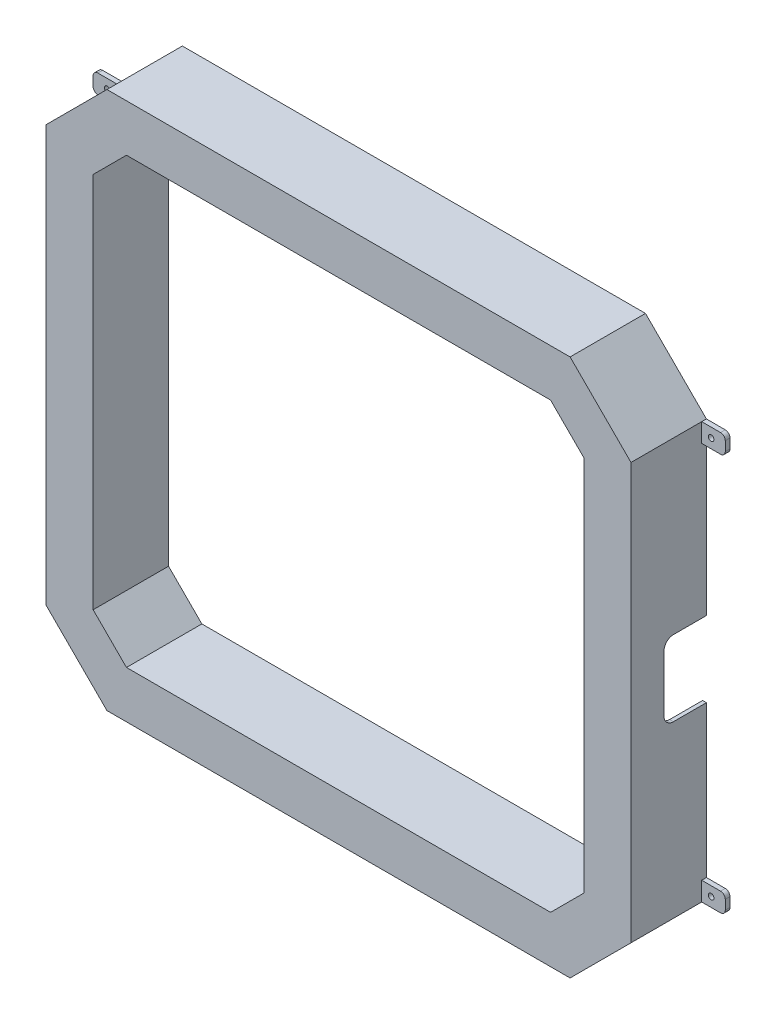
ISO-10303-21;
HEADER;
FILE_DESCRIPTION(('STEP AP214'),'2;1');
FILE_NAME('part.step','',(''),(''),'','','');
FILE_SCHEMA(('AUTOMOTIVE_DESIGN { 1 0 10303 214 1 1 1 1 }'));
ENDSEC;
DATA;
#1=APPLICATION_CONTEXT('core data for automotive mechanical design processes');
#2=APPLICATION_PROTOCOL_DEFINITION('international standard','automotive_design',2000,#1);
#3=PRODUCT_CONTEXT('',#1,'mechanical');
#4=PRODUCT('Part','Part','',(#3));
#5=PRODUCT_RELATED_PRODUCT_CATEGORY('part','',(#4));
#6=PRODUCT_DEFINITION_FORMATION('','',#4);
#7=PRODUCT_DEFINITION_CONTEXT('part definition',#1,'design');
#8=PRODUCT_DEFINITION('design','',#6,#7);
#9=PRODUCT_DEFINITION_SHAPE('','',#8);
#10=(LENGTH_UNIT() NAMED_UNIT(*) SI_UNIT(.MILLI.,.METRE.));
#11=(NAMED_UNIT(*) PLANE_ANGLE_UNIT() SI_UNIT($,.RADIAN.));
#12=(NAMED_UNIT(*) SI_UNIT($,.STERADIAN.) SOLID_ANGLE_UNIT());
#13=UNCERTAINTY_MEASURE_WITH_UNIT(LENGTH_MEASURE(1.E-05),#10,'distance_accuracy_value','');
#14=(GEOMETRIC_REPRESENTATION_CONTEXT(3) GLOBAL_UNCERTAINTY_ASSIGNED_CONTEXT((#13)) GLOBAL_UNIT_ASSIGNED_CONTEXT((#10,
#11,#12)) REPRESENTATION_CONTEXT('',''));
#15=CARTESIAN_POINT('',(0.,0.,0.));
#16=DIRECTION('',(0.,0.,1.));
#17=DIRECTION('',(1.,0.,0.));
#18=AXIS2_PLACEMENT_3D('',#15,#16,#17);
#19=CARTESIAN_POINT('',(85.3553390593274,-456.066017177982,80.));
#20=DIRECTION('',(-1.,0.,0.));
#21=DIRECTION('',(0.,0.,1.));
#22=AXIS2_PLACEMENT_3D('',#19,#20,#21);
#23=PLANE('',#22);
#24=DIRECTION('',(0.,1.,0.));
#25=VECTOR('',#24,1.);
#26=CARTESIAN_POINT('',(85.3553390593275,-456.066017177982,5.));
#27=LINE('',#26,#25);
#28=CARTESIAN_POINT('',(85.3553390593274,-456.066017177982,5.));
#29=VERTEX_POINT('',#28);
#30=CARTESIAN_POINT('',(85.3553390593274,-436.066017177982,5.));
#31=VERTEX_POINT('',#30);
#32=EDGE_CURVE('E638',#29,#31,#27,.T.);
#33=ORIENTED_EDGE('',*,*,#32,.T.);
#34=DIRECTION('',(0.,0.,-1.));
#35=VECTOR('',#34,1.);
#36=CARTESIAN_POINT('',(85.3553390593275,-436.066017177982,5.));
#37=LINE('',#36,#35);
#38=CARTESIAN_POINT('',(85.3553390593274,-436.066017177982,0.));
#39=VERTEX_POINT('',#38);
#40=EDGE_CURVE('E616',#31,#39,#37,.T.);
#41=ORIENTED_EDGE('',*,*,#40,.T.);
#42=DIRECTION('',(0.,1.,0.));
#43=VECTOR('',#42,1.);
#44=CARTESIAN_POINT('',(85.3553390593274,-456.066017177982,0.));
#45=LINE('',#44,#43);
#46=CARTESIAN_POINT('',(85.3553390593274,-275.355339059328,0.));
#47=VERTEX_POINT('',#46);
#48=EDGE_CURVE('E1056',#39,#47,#45,.T.);
#49=ORIENTED_EDGE('',*,*,#48,.T.);
#50=DIRECTION('',(0.,0.,-1.));
#51=VECTOR('',#50,1.);
#52=CARTESIAN_POINT('',(85.3553390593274,-275.355339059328,35.));
#53=LINE('',#52,#51);
#54=CARTESIAN_POINT('',(85.3553390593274,-275.355339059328,35.));
#55=VERTEX_POINT('',#54);
#56=EDGE_CURVE('E827',#55,#47,#53,.T.);
#57=ORIENTED_EDGE('',*,*,#56,.F.);
#58=CARTESIAN_POINT('',(85.3553390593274,-265.355339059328,35.));
#59=DIRECTION('',(1.,0.,0.));
#60=DIRECTION('',(0.,0.,-1.));
#61=AXIS2_PLACEMENT_3D('',#58,#59,#60);
#62=CIRCLE('',#61,10.);
#63=CARTESIAN_POINT('',(85.3553390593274,-265.355339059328,45.));
#64=VERTEX_POINT('',#63);
#65=EDGE_CURVE('E824',#64,#55,#62,.T.);
#66=ORIENTED_EDGE('',*,*,#65,.F.);
#67=DIRECTION('',(0.,-1.,0.));
#68=VECTOR('',#67,1.);
#69=CARTESIAN_POINT('',(85.3553390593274,-205.355339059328,45.));
#70=LINE('',#69,#68);
#71=CARTESIAN_POINT('',(85.3553390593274,-205.355339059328,45.));
#72=VERTEX_POINT('',#71);
#73=EDGE_CURVE('E821',#72,#64,#70,.T.);
#74=ORIENTED_EDGE('',*,*,#73,.F.);
#75=CARTESIAN_POINT('',(85.3553390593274,-205.355339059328,35.));
#76=DIRECTION('',(1.,0.,0.));
#77=DIRECTION('',(0.,0.,-1.));
#78=AXIS2_PLACEMENT_3D('',#75,#76,#77);
#79=CIRCLE('',#78,10.);
#80=CARTESIAN_POINT('',(85.3553390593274,-195.355339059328,35.));
#81=VERTEX_POINT('',#80);
#82=EDGE_CURVE('E818',#81,#72,#79,.T.);
#83=ORIENTED_EDGE('',*,*,#82,.F.);
#84=DIRECTION('',(0.,0.,1.));
#85=VECTOR('',#84,1.);
#86=CARTESIAN_POINT('',(85.3553390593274,-195.355339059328,0.));
#87=LINE('',#86,#85);
#88=CARTESIAN_POINT('',(85.3553390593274,-195.355339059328,0.));
#89=VERTEX_POINT('',#88);
#90=EDGE_CURVE('E815',#89,#81,#87,.T.);
#91=ORIENTED_EDGE('',*,*,#90,.F.);
#92=CARTESIAN_POINT('',(85.3553390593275,-34.6446609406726,0.));
#93=VERTEX_POINT('',#92);
#94=EDGE_CURVE('E1055',#89,#93,#45,.T.);
#95=ORIENTED_EDGE('',*,*,#94,.T.);
#96=DIRECTION('',(0.,0.,-1.));
#97=VECTOR('',#96,1.);
#98=CARTESIAN_POINT('',(85.3553390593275,-34.6446609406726,5.));
#99=LINE('',#98,#97);
#100=CARTESIAN_POINT('',(85.3553390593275,-34.6446609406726,5.));
#101=VERTEX_POINT('',#100);
#102=EDGE_CURVE('E664',#101,#93,#99,.T.);
#103=ORIENTED_EDGE('',*,*,#102,.F.);
#104=DIRECTION('',(0.,1.,0.));
#105=VECTOR('',#104,1.);
#106=CARTESIAN_POINT('',(85.3553390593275,-14.6446609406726,5.));
#107=LINE('',#106,#105);
#108=CARTESIAN_POINT('',(85.3553390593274,-14.6446609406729,5.));
#109=VERTEX_POINT('',#108);
#110=EDGE_CURVE('E689',#101,#109,#107,.T.);
#111=ORIENTED_EDGE('',*,*,#110,.T.);
#112=DIRECTION('',(0.,0.,-1.));
#113=VECTOR('',#112,1.);
#114=CARTESIAN_POINT('',(85.3553390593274,-14.6446609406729,80.));
#115=LINE('',#114,#113);
#116=CARTESIAN_POINT('',(85.3553390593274,-14.6446609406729,80.));
#117=VERTEX_POINT('',#116);
#118=EDGE_CURVE('E1066',#117,#109,#115,.T.);
#119=ORIENTED_EDGE('',*,*,#118,.F.);
#120=DIRECTION('',(0.,1.,0.));
#121=VECTOR('',#120,1.);
#122=CARTESIAN_POINT('',(85.3553390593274,-456.066017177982,80.));
#123=LINE('',#122,#121);
#124=CARTESIAN_POINT('',(85.3553390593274,-456.066017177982,80.));
#125=VERTEX_POINT('',#124);
#126=EDGE_CURVE('E1037',#125,#117,#123,.T.);
#127=ORIENTED_EDGE('',*,*,#126,.F.);
#128=DIRECTION('',(0.,0.,-1.));
#129=VECTOR('',#128,1.);
#130=CARTESIAN_POINT('',(85.3553390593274,-456.066017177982,80.));
#131=LINE('',#130,#129);
#132=EDGE_CURVE('E1069',#125,#29,#131,.T.);
#133=ORIENTED_EDGE('',*,*,#132,.T.);
#134=EDGE_LOOP('',(#33,#41,#49,#57,#66,#74,#83,#91,#95,#103,#111,#119,#127,#133));
#135=FACE_BOUND('',#134,.T.);
#136=ADVANCED_FACE('F45',(#135),#23,.F.);
#137=CARTESIAN_POINT('',(0.,0.,0.));
#138=DIRECTION('',(0.,0.,1.));
#139=DIRECTION('',(1.,0.,0.));
#140=AXIS2_PLACEMENT_3D('',#137,#138,#139);
#141=PLANE('',#140);
#142=DIRECTION('',(0.,-1.,0.));
#143=VECTOR('',#142,1.);
#144=CARTESIAN_POINT('',(-531.355339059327,-14.6446609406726,0.));
#145=LINE('',#144,#143);
#146=CARTESIAN_POINT('',(-531.355339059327,-16.301515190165,0.));
#147=VERTEX_POINT('',#146);
#148=CARTESIAN_POINT('',(-531.355339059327,-195.355339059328,0.));
#149=VERTEX_POINT('',#148);
#150=EDGE_CURVE('E942',#147,#149,#145,.T.);
#151=ORIENTED_EDGE('',*,*,#150,.T.);
#152=DIRECTION('',(-1.,0.,0.));
#153=VECTOR('',#152,1.);
#154=CARTESIAN_POINT('',(85.3563390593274,-195.355339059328,0.));
#155=LINE('',#154,#153);
#156=CARTESIAN_POINT('',(-535.355339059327,-195.355339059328,0.));
#157=VERTEX_POINT('',#156);
#158=EDGE_CURVE('E785',#149,#157,#155,.T.);
#159=ORIENTED_EDGE('',*,*,#158,.T.);
#160=DIRECTION('',(0.,-1.,0.));
#161=VECTOR('',#160,1.);
#162=CARTESIAN_POINT('',(-535.355339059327,-14.6446609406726,0.));
#163=LINE('',#162,#161);
#164=CARTESIAN_POINT('',(-535.355339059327,-34.6446609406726,0.));
#165=VERTEX_POINT('',#164);
#166=EDGE_CURVE('E1047',#165,#157,#163,.T.);
#167=ORIENTED_EDGE('',*,*,#166,.F.);
#168=DIRECTION('',(-1.,0.,0.));
#169=VECTOR('',#168,1.);
#170=CARTESIAN_POINT('',(-535.355339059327,-34.6446609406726,0.));
#171=LINE('',#170,#169);
#172=CARTESIAN_POINT('',(-555.355339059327,-34.6446609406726,0.));
#173=VERTEX_POINT('',#172);
#174=EDGE_CURVE('E712',#165,#173,#171,.T.);
#175=ORIENTED_EDGE('',*,*,#174,.T.);
#176=CARTESIAN_POINT('',(-555.355339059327,-29.6446609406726,0.));
#177=DIRECTION('',(0.,0.,-1.));
#178=DIRECTION('',(-1.,0.,0.));
#179=AXIS2_PLACEMENT_3D('',#176,#177,#178);
#180=CIRCLE('',#179,5.);
#181=CARTESIAN_POINT('',(-560.355339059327,-29.6446609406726,0.));
#182=VERTEX_POINT('',#181);
#183=EDGE_CURVE('E737',#173,#182,#180,.T.);
#184=ORIENTED_EDGE('',*,*,#183,.T.);
#185=DIRECTION('',(0.,1.,0.));
#186=VECTOR('',#185,1.);
#187=CARTESIAN_POINT('',(-560.355339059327,-19.6446609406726,0.));
#188=LINE('',#187,#186);
#189=CARTESIAN_POINT('',(-560.355339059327,-19.6446609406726,0.));
#190=VERTEX_POINT('',#189);
#191=EDGE_CURVE('E740',#182,#190,#188,.T.);
#192=ORIENTED_EDGE('',*,*,#191,.T.);
#193=CARTESIAN_POINT('',(-555.355339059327,-19.6446609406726,0.));
#194=DIRECTION('',(0.,0.,-1.));
#195=DIRECTION('',(1.,0.,0.));
#196=AXIS2_PLACEMENT_3D('',#193,#194,#195);
#197=CIRCLE('',#196,5.);
#198=CARTESIAN_POINT('',(-555.355339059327,-14.6446609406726,0.));
#199=VERTEX_POINT('',#198);
#200=EDGE_CURVE('E743',#190,#199,#197,.T.);
#201=ORIENTED_EDGE('',*,*,#200,.T.);
#202=DIRECTION('',(1.,0.,0.));
#203=VECTOR('',#202,1.);
#204=CARTESIAN_POINT('',(-535.355339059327,-14.6446609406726,0.));
#205=LINE('',#204,#203);
#206=CARTESIAN_POINT('',(-535.355339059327,-14.6446609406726,0.));
#207=VERTEX_POINT('',#206);
#208=EDGE_CURVE('E719',#199,#207,#205,.T.);
#209=ORIENTED_EDGE('',*,*,#208,.T.);
#210=DIRECTION('',(-0.707106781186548,-0.707106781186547,0.));
#211=VECTOR('',#210,1.);
#212=CARTESIAN_POINT('',(-470.710678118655,49.9999999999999,0.));
#213=LINE('',#212,#211);
#214=CARTESIAN_POINT('',(-470.710678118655,49.9999999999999,0.));
#215=VERTEX_POINT('',#214);
#216=EDGE_CURVE('E1024',#215,#207,#213,.T.);
#217=ORIENTED_EDGE('',*,*,#216,.F.);
#218=DIRECTION('',(-1.,0.,0.));
#219=VECTOR('',#218,1.);
#220=CARTESIAN_POINT('',(20.7106781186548,50.,0.));
#221=LINE('',#220,#219);
#222=CARTESIAN_POINT('',(20.7106781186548,50.,0.));
#223=VERTEX_POINT('',#222);
#224=EDGE_CURVE('E1029',#223,#215,#221,.T.);
#225=ORIENTED_EDGE('',*,*,#224,.F.);
#226=DIRECTION('',(-0.707106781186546,0.707106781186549,0.));
#227=VECTOR('',#226,1.);
#228=CARTESIAN_POINT('',(85.3553390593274,-14.6446609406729,0.));
#229=LINE('',#228,#227);
#230=CARTESIAN_POINT('',(85.3553390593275,-14.6446609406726,0.));
#231=VERTEX_POINT('',#230);
#232=EDGE_CURVE('E1058',#231,#223,#229,.T.);
#233=ORIENTED_EDGE('',*,*,#232,.F.);
#234=DIRECTION('',(1.,0.,0.));
#235=VECTOR('',#234,1.);
#236=CARTESIAN_POINT('',(85.3553390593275,-14.6446609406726,0.));
#237=LINE('',#236,#235);
#238=CARTESIAN_POINT('',(105.355339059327,-14.6446609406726,0.));
#239=VERTEX_POINT('',#238);
#240=EDGE_CURVE('E670',#231,#239,#237,.T.);
#241=ORIENTED_EDGE('',*,*,#240,.T.);
#242=CARTESIAN_POINT('',(105.355339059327,-19.6446609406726,0.));
#243=DIRECTION('',(0.,0.,-1.));
#244=DIRECTION('',(-1.,0.,0.));
#245=AXIS2_PLACEMENT_3D('',#242,#243,#244);
#246=CIRCLE('',#245,5.);
#247=CARTESIAN_POINT('',(110.355339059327,-19.6446609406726,0.));
#248=VERTEX_POINT('',#247);
#249=EDGE_CURVE('E683',#239,#248,#246,.T.);
#250=ORIENTED_EDGE('',*,*,#249,.T.);
#251=DIRECTION('',(0.,-1.,0.));
#252=VECTOR('',#251,1.);
#253=CARTESIAN_POINT('',(110.355339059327,-19.6446609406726,0.));
#254=LINE('',#253,#252);
#255=CARTESIAN_POINT('',(110.355339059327,-29.6446609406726,0.));
#256=VERTEX_POINT('',#255);
#257=EDGE_CURVE('E680',#248,#256,#254,.T.);
#258=ORIENTED_EDGE('',*,*,#257,.T.);
#259=CARTESIAN_POINT('',(105.355339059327,-29.6446609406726,0.));
#260=DIRECTION('',(0.,0.,-1.));
#261=DIRECTION('',(1.,0.,0.));
#262=AXIS2_PLACEMENT_3D('',#259,#260,#261);
#263=CIRCLE('',#262,5.);
#264=CARTESIAN_POINT('',(105.355339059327,-34.6446609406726,0.));
#265=VERTEX_POINT('',#264);
#266=EDGE_CURVE('E677',#256,#265,#263,.T.);
#267=ORIENTED_EDGE('',*,*,#266,.T.);
#268=DIRECTION('',(-1.,0.,0.));
#269=VECTOR('',#268,1.);
#270=CARTESIAN_POINT('',(85.3553390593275,-34.6446609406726,0.));
#271=LINE('',#270,#269);
#272=EDGE_CURVE('E673',#265,#93,#271,.T.);
#273=ORIENTED_EDGE('',*,*,#272,.T.);
#274=ORIENTED_EDGE('',*,*,#94,.F.);
#275=DIRECTION('',(1.,0.,0.));
#276=VECTOR('',#275,1.);
#277=CARTESIAN_POINT('',(-535.356339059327,-195.355339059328,0.));
#278=LINE('',#277,#276);
#279=CARTESIAN_POINT('',(81.3553390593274,-195.355339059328,0.));
#280=VERTEX_POINT('',#279);
#281=EDGE_CURVE('E830',#280,#89,#278,.T.);
#282=ORIENTED_EDGE('',*,*,#281,.F.);
#283=DIRECTION('',(0.,1.,0.));
#284=VECTOR('',#283,1.);
#285=CARTESIAN_POINT('',(81.3553390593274,-456.066017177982,0.));
#286=LINE('',#285,#284);
#287=CARTESIAN_POINT('',(81.3553390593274,-16.3015151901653,0.));
#288=VERTEX_POINT('',#287);
#289=EDGE_CURVE('E932',#280,#288,#286,.T.);
#290=ORIENTED_EDGE('',*,*,#289,.T.);
#291=DIRECTION('',(-0.707106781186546,0.707106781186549,0.));
#292=VECTOR('',#291,1.);
#293=CARTESIAN_POINT('',(82.5269119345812,-17.4730880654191,0.));
#294=LINE('',#293,#292);
#295=CARTESIAN_POINT('',(19.0538238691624,46.,0.));
#296=VERTEX_POINT('',#295);
#297=EDGE_CURVE('E926',#288,#296,#294,.T.);
#298=ORIENTED_EDGE('',*,*,#297,.T.);
#299=DIRECTION('',(-1.,0.,0.));
#300=VECTOR('',#299,1.);
#301=CARTESIAN_POINT('',(20.7106781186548,46.,0.));
#302=LINE('',#301,#300);
#303=CARTESIAN_POINT('',(-469.053823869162,45.9999999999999,0.));
#304=VERTEX_POINT('',#303);
#305=EDGE_CURVE('E851',#296,#304,#302,.T.);
#306=ORIENTED_EDGE('',*,*,#305,.T.);
#307=DIRECTION('',(-0.707106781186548,-0.707106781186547,0.));
#308=VECTOR('',#307,1.);
#309=CARTESIAN_POINT('',(-467.882250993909,47.1715728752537,0.));
#310=LINE('',#309,#308);
#311=EDGE_CURVE('E908',#304,#147,#310,.T.);
#312=ORIENTED_EDGE('',*,*,#311,.T.);
#313=EDGE_LOOP('',(#151,#159,#167,#175,#184,#192,#201,#209,#217,#225,#233,#241,#250,#258,#267,
#273,#274,#282,#290,#298,#306,#312));
#314=FACE_BOUND('',#313,.T.);
#315=CARTESIAN_POINT('',(-545.355339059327,-24.6446609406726,0.));
#316=DIRECTION('',(0.,0.,-1.));
#317=DIRECTION('',(-1.,0.,0.));
#318=AXIS2_PLACEMENT_3D('',#315,#316,#317);
#319=CIRCLE('',#318,2.99999999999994);
#320=CARTESIAN_POINT('',(-548.355339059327,-24.6446609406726,0.));
#321=VERTEX_POINT('',#320);
#322=EDGE_CURVE('E706',#321,#321,#319,.T.);
#323=ORIENTED_EDGE('',*,*,#322,.F.);
#324=EDGE_LOOP('',(#323));
#325=FACE_BOUND('',#324,.T.);
#326=CARTESIAN_POINT('',(95.3553390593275,-24.6446609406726,0.));
#327=DIRECTION('',(0.,0.,-1.));
#328=DIRECTION('',(1.,0.,0.));
#329=AXIS2_PLACEMENT_3D('',#326,#327,#328);
#330=CIRCLE('',#329,2.99999999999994);
#331=CARTESIAN_POINT('',(98.3553390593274,-24.6446609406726,0.));
#332=VERTEX_POINT('',#331);
#333=EDGE_CURVE('E703',#332,#332,#330,.T.);
#334=ORIENTED_EDGE('',*,*,#333,.F.);
#335=EDGE_LOOP('',(#334));
#336=FACE_BOUND('',#335,.T.);
#337=ADVANCED_FACE('F1153',(#314,#325,#336),#141,.F.);
#338=DIRECTION('',(-0.707106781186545,0.707106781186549,0.));
#339=VECTOR('',#338,1.);
#340=CARTESIAN_POINT('',(35.3553390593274,-35.3553390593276,0.));
#341=LINE('',#340,#339);
#342=CARTESIAN_POINT('',(35.3553390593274,-35.3553390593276,0.));
#343=VERTEX_POINT('',#342);
#344=CARTESIAN_POINT('',(0.,0.,0.));
#345=VERTEX_POINT('',#344);
#346=EDGE_CURVE('E888',#343,#345,#341,.T.);
#347=ORIENTED_EDGE('',*,*,#346,.T.);
#348=DIRECTION('',(-1.,0.,0.));
#349=VECTOR('',#348,1.);
#350=CARTESIAN_POINT('',(0.,0.,0.));
#351=LINE('',#350,#349);
#352=CARTESIAN_POINT('',(-450.,0.,0.));
#353=VERTEX_POINT('',#352);
#354=EDGE_CURVE('E987',#345,#353,#351,.T.);
#355=ORIENTED_EDGE('',*,*,#354,.T.);
#356=DIRECTION('',(-0.707106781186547,-0.707106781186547,0.));
#357=VECTOR('',#356,1.);
#358=CARTESIAN_POINT('',(-450.,0.,0.));
#359=LINE('',#358,#357);
#360=CARTESIAN_POINT('',(-485.355339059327,-35.3553390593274,0.));
#361=VERTEX_POINT('',#360);
#362=EDGE_CURVE('E990',#353,#361,#359,.T.);
#363=ORIENTED_EDGE('',*,*,#362,.T.);
#364=DIRECTION('',(0.,-1.,0.));
#365=VECTOR('',#364,1.);
#366=CARTESIAN_POINT('',(-485.355339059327,-35.3553390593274,0.));
#367=LINE('',#366,#365);
#368=CARTESIAN_POINT('',(-485.355339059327,-435.355339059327,0.));
#369=VERTEX_POINT('',#368);
#370=EDGE_CURVE('E993',#361,#369,#367,.T.);
#371=ORIENTED_EDGE('',*,*,#370,.T.);
#372=DIRECTION('',(0.707106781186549,-0.707106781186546,0.));
#373=VECTOR('',#372,1.);
#374=CARTESIAN_POINT('',(-485.355339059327,-435.355339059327,0.));
#375=LINE('',#374,#373);
#376=CARTESIAN_POINT('',(-450.,-470.710678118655,0.));
#377=VERTEX_POINT('',#376);
#378=EDGE_CURVE('E996',#369,#377,#375,.T.);
#379=ORIENTED_EDGE('',*,*,#378,.T.);
#380=DIRECTION('',(1.,0.,0.));
#381=VECTOR('',#380,1.);
#382=CARTESIAN_POINT('',(-450.,-470.710678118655,0.));
#383=LINE('',#382,#381);
#384=CARTESIAN_POINT('',(0.,-470.710678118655,0.));
#385=VERTEX_POINT('',#384);
#386=EDGE_CURVE('E999',#377,#385,#383,.T.);
#387=ORIENTED_EDGE('',*,*,#386,.T.);
#388=DIRECTION('',(0.707106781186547,0.707106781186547,0.));
#389=VECTOR('',#388,1.);
#390=CARTESIAN_POINT('',(0.,-470.710678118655,0.));
#391=LINE('',#390,#389);
#392=CARTESIAN_POINT('',(35.3553390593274,-435.355339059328,0.));
#393=VERTEX_POINT('',#392);
#394=EDGE_CURVE('E1002',#385,#393,#391,.T.);
#395=ORIENTED_EDGE('',*,*,#394,.T.);
#396=DIRECTION('',(0.,1.,0.));
#397=VECTOR('',#396,1.);
#398=CARTESIAN_POINT('',(35.3553390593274,-435.355339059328,0.));
#399=LINE('',#398,#397);
#400=EDGE_CURVE('E969',#393,#343,#399,.T.);
#401=ORIENTED_EDGE('',*,*,#400,.T.);
#402=EDGE_LOOP('',(#347,#355,#363,#371,#379,#387,#395,#401));
#403=FACE_BOUND('',#402,.T.);
#404=DIRECTION('',(-0.707106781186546,0.707106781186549,0.));
#405=VECTOR('',#404,1.);
#406=CARTESIAN_POINT('',(38.1837661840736,-32.5269119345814,0.));
#407=LINE('',#406,#405);
#408=CARTESIAN_POINT('',(39.3553390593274,-33.6984848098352,0.));
#409=VERTEX_POINT('',#408);
#410=CARTESIAN_POINT('',(1.65685424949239,4.,0.));
#411=VERTEX_POINT('',#410);
#412=EDGE_CURVE('E846',#409,#411,#407,.T.);
#413=ORIENTED_EDGE('',*,*,#412,.F.);
#414=DIRECTION('',(0.,1.,0.));
#415=VECTOR('',#414,1.);
#416=CARTESIAN_POINT('',(39.3553390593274,-435.355339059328,0.));
#417=LINE('',#416,#415);
#418=CARTESIAN_POINT('',(39.3553390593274,-437.01219330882,0.));
#419=VERTEX_POINT('',#418);
#420=EDGE_CURVE('E871',#419,#409,#417,.T.);
#421=ORIENTED_EDGE('',*,*,#420,.F.);
#422=DIRECTION('',(0.707106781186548,0.707106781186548,0.));
#423=VECTOR('',#422,1.);
#424=CARTESIAN_POINT('',(2.8284271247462,-473.539105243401,0.));
#425=LINE('',#424,#423);
#426=CARTESIAN_POINT('',(1.65685424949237,-474.710678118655,0.));
#427=VERTEX_POINT('',#426);
#428=EDGE_CURVE('E962',#427,#419,#425,.T.);
#429=ORIENTED_EDGE('',*,*,#428,.F.);
#430=DIRECTION('',(1.,0.,0.));
#431=VECTOR('',#430,1.);
#432=CARTESIAN_POINT('',(-450.,-474.710678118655,0.));
#433=LINE('',#432,#431);
#434=CARTESIAN_POINT('',(-451.656854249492,-474.710678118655,0.));
#435=VERTEX_POINT('',#434);
#436=EDGE_CURVE('E959',#435,#427,#433,.T.);
#437=ORIENTED_EDGE('',*,*,#436,.F.);
#438=DIRECTION('',(0.707106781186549,-0.707106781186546,0.));
#439=VECTOR('',#438,1.);
#440=CARTESIAN_POINT('',(-488.183766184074,-438.183766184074,0.));
#441=LINE('',#440,#439);
#442=CARTESIAN_POINT('',(-489.355339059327,-437.01219330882,0.));
#443=VERTEX_POINT('',#442);
#444=EDGE_CURVE('E956',#443,#435,#441,.T.);
#445=ORIENTED_EDGE('',*,*,#444,.F.);
#446=DIRECTION('',(0.,-1.,0.));
#447=VECTOR('',#446,1.);
#448=CARTESIAN_POINT('',(-489.355339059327,-35.3553390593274,0.));
#449=LINE('',#448,#447);
#450=CARTESIAN_POINT('',(-489.355339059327,-33.698484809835,0.));
#451=VERTEX_POINT('',#450);
#452=EDGE_CURVE('E953',#451,#443,#449,.T.);
#453=ORIENTED_EDGE('',*,*,#452,.F.);
#454=DIRECTION('',(-0.707106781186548,-0.707106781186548,0.));
#455=VECTOR('',#454,1.);
#456=CARTESIAN_POINT('',(-452.828427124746,2.82842712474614,0.));
#457=LINE('',#456,#455);
#458=CARTESIAN_POINT('',(-451.656854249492,3.99999999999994,0.));
#459=VERTEX_POINT('',#458);
#460=EDGE_CURVE('E950',#459,#451,#457,.T.);
#461=ORIENTED_EDGE('',*,*,#460,.F.);
#462=DIRECTION('',(-1.,0.,0.));
#463=VECTOR('',#462,1.);
#464=CARTESIAN_POINT('',(0.,4.,0.));
#465=LINE('',#464,#463);
#466=EDGE_CURVE('E947',#411,#459,#465,.T.);
#467=ORIENTED_EDGE('',*,*,#466,.F.);
#468=EDGE_LOOP('',(#413,#421,#429,#437,#445,#453,#461,#467));
#469=FACE_BOUND('',#468,.T.);
#470=ADVANCED_FACE('F1304',(#403,#469),#141,.F.);
#471=CARTESIAN_POINT('',(0.,0.,80.));
#472=DIRECTION('',(0.,0.,1.));
#473=DIRECTION('',(1.,0.,0.));
#474=AXIS2_PLACEMENT_3D('',#471,#472,#473);
#475=PLANE('',#474);
#476=DIRECTION('',(-0.707106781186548,-0.707106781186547,0.));
#477=VECTOR('',#476,1.);
#478=CARTESIAN_POINT('',(-470.710678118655,49.9999999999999,80.));
#479=LINE('',#478,#477);
#480=CARTESIAN_POINT('',(-470.710678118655,49.9999999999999,80.));
#481=VERTEX_POINT('',#480);
#482=CARTESIAN_POINT('',(-535.355339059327,-14.6446609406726,80.));
#483=VERTEX_POINT('',#482);
#484=EDGE_CURVE('E1025',#481,#483,#479,.T.);
#485=ORIENTED_EDGE('',*,*,#484,.T.);
#486=DIRECTION('',(0.,-1.,0.));
#487=VECTOR('',#486,1.);
#488=CARTESIAN_POINT('',(-535.355339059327,-14.6446609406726,80.));
#489=LINE('',#488,#487);
#490=CARTESIAN_POINT('',(-535.355339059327,-456.066017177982,80.));
#491=VERTEX_POINT('',#490);
#492=EDGE_CURVE('E1028',#483,#491,#489,.T.);
#493=ORIENTED_EDGE('',*,*,#492,.T.);
#494=DIRECTION('',(0.707106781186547,-0.707106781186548,0.));
#495=VECTOR('',#494,1.);
#496=CARTESIAN_POINT('',(-535.355339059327,-456.066017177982,80.));
#497=LINE('',#496,#495);
#498=CARTESIAN_POINT('',(-470.710678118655,-520.710678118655,80.));
#499=VERTEX_POINT('',#498);
#500=EDGE_CURVE('E1031',#491,#499,#497,.T.);
#501=ORIENTED_EDGE('',*,*,#500,.T.);
#502=DIRECTION('',(1.,0.,0.));
#503=VECTOR('',#502,1.);
#504=CARTESIAN_POINT('',(-470.710678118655,-520.710678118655,80.));
#505=LINE('',#504,#503);
#506=CARTESIAN_POINT('',(20.7106781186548,-520.710678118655,80.));
#507=VERTEX_POINT('',#506);
#508=EDGE_CURVE('E1033',#499,#507,#505,.T.);
#509=ORIENTED_EDGE('',*,*,#508,.T.);
#510=DIRECTION('',(0.707106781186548,0.707106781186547,0.));
#511=VECTOR('',#510,1.);
#512=CARTESIAN_POINT('',(20.7106781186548,-520.710678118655,80.));
#513=LINE('',#512,#511);
#514=EDGE_CURVE('E1035',#507,#125,#513,.T.);
#515=ORIENTED_EDGE('',*,*,#514,.T.);
#516=ORIENTED_EDGE('',*,*,#126,.T.);
#517=DIRECTION('',(-0.707106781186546,0.707106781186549,0.));
#518=VECTOR('',#517,1.);
#519=CARTESIAN_POINT('',(85.3553390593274,-14.6446609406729,80.));
#520=LINE('',#519,#518);
#521=CARTESIAN_POINT('',(20.7106781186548,50.,80.));
#522=VERTEX_POINT('',#521);
#523=EDGE_CURVE('E1039',#117,#522,#520,.T.);
#524=ORIENTED_EDGE('',*,*,#523,.T.);
#525=DIRECTION('',(-1.,0.,0.));
#526=VECTOR('',#525,1.);
#527=CARTESIAN_POINT('',(20.7106781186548,50.,80.));
#528=LINE('',#527,#526);
#529=EDGE_CURVE('E1041',#522,#481,#528,.T.);
#530=ORIENTED_EDGE('',*,*,#529,.T.);
#531=EDGE_LOOP('',(#485,#493,#501,#509,#515,#516,#524,#530));
#532=FACE_BOUND('',#531,.T.);
#533=DIRECTION('',(-1.,0.,0.));
#534=VECTOR('',#533,1.);
#535=CARTESIAN_POINT('',(0.,0.,80.));
#536=LINE('',#535,#534);
#537=CARTESIAN_POINT('',(0.,0.,80.));
#538=VERTEX_POINT('',#537);
#539=CARTESIAN_POINT('',(-450.,0.,80.));
#540=VERTEX_POINT('',#539);
#541=EDGE_CURVE('E968',#538,#540,#536,.T.);
#542=ORIENTED_EDGE('',*,*,#541,.F.);
#543=DIRECTION('',(-0.707106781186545,0.707106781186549,0.));
#544=VECTOR('',#543,1.);
#545=CARTESIAN_POINT('',(35.3553390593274,-35.3553390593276,80.));
#546=LINE('',#545,#544);
#547=CARTESIAN_POINT('',(35.3553390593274,-35.3553390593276,80.));
#548=VERTEX_POINT('',#547);
#549=EDGE_CURVE('E966',#548,#538,#546,.T.);
#550=ORIENTED_EDGE('',*,*,#549,.F.);
#551=DIRECTION('',(0.,1.,0.));
#552=VECTOR('',#551,1.);
#553=CARTESIAN_POINT('',(35.3553390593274,-435.355339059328,80.));
#554=LINE('',#553,#552);
#555=CARTESIAN_POINT('',(35.3553390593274,-435.355339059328,80.));
#556=VERTEX_POINT('',#555);
#557=EDGE_CURVE('E982',#556,#548,#554,.T.);
#558=ORIENTED_EDGE('',*,*,#557,.F.);
#559=DIRECTION('',(0.707106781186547,0.707106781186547,0.));
#560=VECTOR('',#559,1.);
#561=CARTESIAN_POINT('',(0.,-470.710678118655,80.));
#562=LINE('',#561,#560);
#563=CARTESIAN_POINT('',(0.,-470.710678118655,80.));
#564=VERTEX_POINT('',#563);
#565=EDGE_CURVE('E979',#564,#556,#562,.T.);
#566=ORIENTED_EDGE('',*,*,#565,.F.);
#567=DIRECTION('',(1.,0.,0.));
#568=VECTOR('',#567,1.);
#569=CARTESIAN_POINT('',(-450.,-470.710678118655,80.));
#570=LINE('',#569,#568);
#571=CARTESIAN_POINT('',(-450.,-470.710678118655,80.));
#572=VERTEX_POINT('',#571);
#573=EDGE_CURVE('E977',#572,#564,#570,.T.);
#574=ORIENTED_EDGE('',*,*,#573,.F.);
#575=DIRECTION('',(0.707106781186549,-0.707106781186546,0.));
#576=VECTOR('',#575,1.);
#577=CARTESIAN_POINT('',(-485.355339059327,-435.355339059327,80.));
#578=LINE('',#577,#576);
#579=CARTESIAN_POINT('',(-485.355339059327,-435.355339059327,80.));
#580=VERTEX_POINT('',#579);
#581=EDGE_CURVE('E975',#580,#572,#578,.T.);
#582=ORIENTED_EDGE('',*,*,#581,.F.);
#583=DIRECTION('',(0.,-1.,0.));
#584=VECTOR('',#583,1.);
#585=CARTESIAN_POINT('',(-485.355339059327,-35.3553390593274,80.));
#586=LINE('',#585,#584);
#587=CARTESIAN_POINT('',(-485.355339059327,-35.3553390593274,80.));
#588=VERTEX_POINT('',#587);
#589=EDGE_CURVE('E973',#588,#580,#586,.T.);
#590=ORIENTED_EDGE('',*,*,#589,.F.);
#591=DIRECTION('',(-0.707106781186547,-0.707106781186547,0.));
#592=VECTOR('',#591,1.);
#593=CARTESIAN_POINT('',(-450.,0.,80.));
#594=LINE('',#593,#592);
#595=EDGE_CURVE('E971',#540,#588,#594,.T.);
#596=ORIENTED_EDGE('',*,*,#595,.F.);
#597=EDGE_LOOP('',(#542,#550,#558,#566,#574,#582,#590,#596));
#598=FACE_BOUND('',#597,.T.);
#599=ADVANCED_FACE('F1121',(#532,#598),#475,.T.);
#600=CARTESIAN_POINT('',(-535.355339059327,-275.355339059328,0.));
#601=VERTEX_POINT('',#600);
#602=CARTESIAN_POINT('',(-535.355339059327,-436.066017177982,0.));
#603=VERTEX_POINT('',#602);
#604=EDGE_CURVE('E1046',#601,#603,#163,.T.);
#605=ORIENTED_EDGE('',*,*,#604,.F.);
#606=DIRECTION('',(-1.,0.,0.));
#607=VECTOR('',#606,1.);
#608=CARTESIAN_POINT('',(85.3563390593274,-275.355339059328,0.));
#609=LINE('',#608,#607);
#610=CARTESIAN_POINT('',(-531.355339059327,-275.355339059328,0.));
#611=VERTEX_POINT('',#610);
#612=EDGE_CURVE('E750',#611,#601,#609,.T.);
#613=ORIENTED_EDGE('',*,*,#612,.F.);
#614=CARTESIAN_POINT('',(-531.355339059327,-454.40916292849,0.));
#615=VERTEX_POINT('',#614);
#616=EDGE_CURVE('E923',#611,#615,#145,.T.);
#617=ORIENTED_EDGE('',*,*,#616,.T.);
#618=DIRECTION('',(0.707106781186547,-0.707106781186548,0.));
#619=VECTOR('',#618,1.);
#620=CARTESIAN_POINT('',(-532.526911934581,-453.237590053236,0.));
#621=LINE('',#620,#619);
#622=CARTESIAN_POINT('',(-469.053823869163,-516.710678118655,0.));
#623=VERTEX_POINT('',#622);
#624=EDGE_CURVE('E939',#615,#623,#621,.T.);
#625=ORIENTED_EDGE('',*,*,#624,.T.);
#626=DIRECTION('',(1.,0.,0.));
#627=VECTOR('',#626,1.);
#628=CARTESIAN_POINT('',(-470.710678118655,-516.710678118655,0.));
#629=LINE('',#628,#627);
#630=CARTESIAN_POINT('',(19.0538238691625,-516.710678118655,0.));
#631=VERTEX_POINT('',#630);
#632=EDGE_CURVE('E936',#623,#631,#629,.T.);
#633=ORIENTED_EDGE('',*,*,#632,.T.);
#634=DIRECTION('',(0.707106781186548,0.707106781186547,0.));
#635=VECTOR('',#634,1.);
#636=CARTESIAN_POINT('',(17.8822509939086,-517.882250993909,0.));
#637=LINE('',#636,#635);
#638=CARTESIAN_POINT('',(81.3553390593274,-454.40916292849,0.));
#639=VERTEX_POINT('',#638);
#640=EDGE_CURVE('E933',#631,#639,#637,.T.);
#641=ORIENTED_EDGE('',*,*,#640,.T.);
#642=CARTESIAN_POINT('',(81.3553390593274,-275.355339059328,0.));
#643=VERTEX_POINT('',#642);
#644=EDGE_CURVE('E929',#639,#643,#286,.T.);
#645=ORIENTED_EDGE('',*,*,#644,.T.);
#646=DIRECTION('',(1.,0.,0.));
#647=VECTOR('',#646,1.);
#648=CARTESIAN_POINT('',(-535.356339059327,-275.355339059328,0.));
#649=LINE('',#648,#647);
#650=EDGE_CURVE('E831',#643,#47,#649,.T.);
#651=ORIENTED_EDGE('',*,*,#650,.T.);
#652=ORIENTED_EDGE('',*,*,#48,.F.);
#653=DIRECTION('',(1.,0.,0.));
#654=VECTOR('',#653,1.);
#655=CARTESIAN_POINT('',(85.3553390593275,-436.066017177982,0.));
#656=LINE('',#655,#654);
#657=CARTESIAN_POINT('',(105.355339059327,-436.066017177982,0.));
#658=VERTEX_POINT('',#657);
#659=EDGE_CURVE('E619',#39,#658,#656,.T.);
#660=ORIENTED_EDGE('',*,*,#659,.T.);
#661=CARTESIAN_POINT('',(105.355339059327,-441.066017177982,0.));
#662=DIRECTION('',(0.,0.,-1.));
#663=DIRECTION('',(-1.,0.,0.));
#664=AXIS2_PLACEMENT_3D('',#661,#662,#663);
#665=CIRCLE('',#664,4.99999999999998);
#666=CARTESIAN_POINT('',(110.355339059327,-441.066017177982,0.));
#667=VERTEX_POINT('',#666);
#668=EDGE_CURVE('E632',#658,#667,#665,.T.);
#669=ORIENTED_EDGE('',*,*,#668,.T.);
#670=DIRECTION('',(0.,-1.,0.));
#671=VECTOR('',#670,1.);
#672=CARTESIAN_POINT('',(110.355339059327,-451.066017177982,0.));
#673=LINE('',#672,#671);
#674=CARTESIAN_POINT('',(110.355339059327,-451.066017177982,0.));
#675=VERTEX_POINT('',#674);
#676=EDGE_CURVE('E629',#667,#675,#673,.T.);
#677=ORIENTED_EDGE('',*,*,#676,.T.);
#678=CARTESIAN_POINT('',(105.355339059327,-451.066017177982,0.));
#679=DIRECTION('',(0.,0.,-1.));
#680=DIRECTION('',(1.,0.,0.));
#681=AXIS2_PLACEMENT_3D('',#678,#679,#680);
#682=CIRCLE('',#681,5.);
#683=CARTESIAN_POINT('',(105.355339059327,-456.066017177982,0.));
#684=VERTEX_POINT('',#683);
#685=EDGE_CURVE('E626',#675,#684,#682,.T.);
#686=ORIENTED_EDGE('',*,*,#685,.T.);
#687=DIRECTION('',(-1.,0.,0.));
#688=VECTOR('',#687,1.);
#689=CARTESIAN_POINT('',(85.3553390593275,-456.066017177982,0.));
#690=LINE('',#689,#688);
#691=CARTESIAN_POINT('',(85.3553390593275,-456.066017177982,0.));
#692=VERTEX_POINT('',#691);
#693=EDGE_CURVE('E622',#684,#692,#690,.T.);
#694=ORIENTED_EDGE('',*,*,#693,.T.);
#695=DIRECTION('',(0.707106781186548,0.707106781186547,0.));
#696=VECTOR('',#695,1.);
#697=CARTESIAN_POINT('',(20.7106781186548,-520.710678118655,0.));
#698=LINE('',#697,#696);
#699=CARTESIAN_POINT('',(20.7106781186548,-520.710678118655,0.));
#700=VERTEX_POINT('',#699);
#701=EDGE_CURVE('E1053',#700,#692,#698,.T.);
#702=ORIENTED_EDGE('',*,*,#701,.F.);
#703=DIRECTION('',(1.,0.,0.));
#704=VECTOR('',#703,1.);
#705=CARTESIAN_POINT('',(-470.710678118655,-520.710678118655,0.));
#706=LINE('',#705,#704);
#707=CARTESIAN_POINT('',(-470.710678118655,-520.710678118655,0.));
#708=VERTEX_POINT('',#707);
#709=EDGE_CURVE('E1051',#708,#700,#706,.T.);
#710=ORIENTED_EDGE('',*,*,#709,.F.);
#711=DIRECTION('',(0.707106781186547,-0.707106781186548,0.));
#712=VECTOR('',#711,1.);
#713=CARTESIAN_POINT('',(-535.355339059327,-456.066017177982,0.));
#714=LINE('',#713,#712);
#715=CARTESIAN_POINT('',(-535.355339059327,-456.066017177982,0.));
#716=VERTEX_POINT('',#715);
#717=EDGE_CURVE('E1049',#716,#708,#714,.T.);
#718=ORIENTED_EDGE('',*,*,#717,.F.);
#719=DIRECTION('',(-1.,0.,0.));
#720=VECTOR('',#719,1.);
#721=CARTESIAN_POINT('',(-535.355339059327,-456.066017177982,0.));
#722=LINE('',#721,#720);
#723=CARTESIAN_POINT('',(-555.355339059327,-456.066017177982,0.));
#724=VERTEX_POINT('',#723);
#725=EDGE_CURVE('E567',#716,#724,#722,.T.);
#726=ORIENTED_EDGE('',*,*,#725,.T.);
#727=CARTESIAN_POINT('',(-555.355339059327,-451.066017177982,0.));
#728=DIRECTION('',(0.,0.,-1.));
#729=DIRECTION('',(-1.,0.,0.));
#730=AXIS2_PLACEMENT_3D('',#727,#728,#729);
#731=CIRCLE('',#730,5.);
#732=CARTESIAN_POINT('',(-560.355339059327,-451.066017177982,0.));
#733=VERTEX_POINT('',#732);
#734=EDGE_CURVE('E580',#724,#733,#731,.T.);
#735=ORIENTED_EDGE('',*,*,#734,.T.);
#736=DIRECTION('',(0.,1.,0.));
#737=VECTOR('',#736,1.);
#738=CARTESIAN_POINT('',(-560.355339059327,-451.066017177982,0.));
#739=LINE('',#738,#737);
#740=CARTESIAN_POINT('',(-560.355339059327,-441.066017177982,0.));
#741=VERTEX_POINT('',#740);
#742=EDGE_CURVE('E577',#733,#741,#739,.T.);
#743=ORIENTED_EDGE('',*,*,#742,.T.);
#744=CARTESIAN_POINT('',(-555.355339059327,-441.066017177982,0.));
#745=DIRECTION('',(0.,0.,-1.));
#746=DIRECTION('',(1.,0.,0.));
#747=AXIS2_PLACEMENT_3D('',#744,#745,#746);
#748=CIRCLE('',#747,4.99999999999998);
#749=CARTESIAN_POINT('',(-555.355339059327,-436.066017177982,0.));
#750=VERTEX_POINT('',#749);
#751=EDGE_CURVE('E574',#741,#750,#748,.T.);
#752=ORIENTED_EDGE('',*,*,#751,.T.);
#753=DIRECTION('',(1.,0.,0.));
#754=VECTOR('',#753,1.);
#755=CARTESIAN_POINT('',(-535.355339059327,-436.066017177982,0.));
#756=LINE('',#755,#754);
#757=EDGE_CURVE('E570',#750,#603,#756,.T.);
#758=ORIENTED_EDGE('',*,*,#757,.T.);
#759=EDGE_LOOP('',(#605,#613,#617,#625,#633,#641,#645,#651,#652,#660,#669,#677,#686,#694,#702,
#710,#718,#726,#735,#743,#752,#758));
#760=FACE_BOUND('',#759,.T.);
#761=CARTESIAN_POINT('',(95.3553390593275,-446.066017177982,0.));
#762=DIRECTION('',(0.,0.,-1.));
#763=DIRECTION('',(-1.,0.,0.));
#764=AXIS2_PLACEMENT_3D('',#761,#762,#763);
#765=CIRCLE('',#764,2.99999999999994);
#766=CARTESIAN_POINT('',(92.3553390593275,-446.066017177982,0.));
#767=VERTEX_POINT('',#766);
#768=EDGE_CURVE('E651',#767,#767,#765,.T.);
#769=ORIENTED_EDGE('',*,*,#768,.F.);
#770=EDGE_LOOP('',(#769));
#771=FACE_BOUND('',#770,.T.);
#772=CARTESIAN_POINT('',(-545.355339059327,-446.066017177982,0.));
#773=DIRECTION('',(0.,0.,-1.));
#774=DIRECTION('',(1.,0.,0.));
#775=AXIS2_PLACEMENT_3D('',#772,#773,#774);
#776=CIRCLE('',#775,2.99999999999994);
#777=CARTESIAN_POINT('',(-542.355339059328,-446.066017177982,0.));
#778=VERTEX_POINT('',#777);
#779=EDGE_CURVE('E600',#778,#778,#776,.T.);
#780=ORIENTED_EDGE('',*,*,#779,.F.);
#781=EDGE_LOOP('',(#780));
#782=FACE_BOUND('',#781,.T.);
#783=ADVANCED_FACE('F1111',(#760,#771,#782),#141,.F.);
#784=CARTESIAN_POINT('',(-470.710678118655,49.9999999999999,80.));
#785=DIRECTION('',(0.707106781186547,-0.707106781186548,0.));
#786=DIRECTION('',(0.707106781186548,0.707106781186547,0.));
#787=AXIS2_PLACEMENT_3D('',#784,#785,#786);
#788=PLANE('',#787);
#789=ORIENTED_EDGE('',*,*,#216,.T.);
#790=DIRECTION('',(0.,0.,-1.));
#791=VECTOR('',#790,1.);
#792=CARTESIAN_POINT('',(-535.355339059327,-14.6446609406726,5.));
#793=LINE('',#792,#791);
#794=CARTESIAN_POINT('',(-535.355339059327,-14.6446609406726,5.));
#795=VERTEX_POINT('',#794);
#796=EDGE_CURVE('E748',#795,#207,#793,.T.);
#797=ORIENTED_EDGE('',*,*,#796,.F.);
#798=DIRECTION('',(0.,0.,-1.));
#799=VECTOR('',#798,1.);
#800=CARTESIAN_POINT('',(-535.355339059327,-14.6446609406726,80.));
#801=LINE('',#800,#799);
#802=EDGE_CURVE('E11',#483,#795,#801,.T.);
#803=ORIENTED_EDGE('',*,*,#802,.F.);
#804=ORIENTED_EDGE('',*,*,#484,.F.);
#805=DIRECTION('',(0.,0.,-1.));
#806=VECTOR('',#805,1.);
#807=CARTESIAN_POINT('',(-470.710678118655,49.9999999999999,80.));
#808=LINE('',#807,#806);
#809=EDGE_CURVE('E1043',#481,#215,#808,.T.);
#810=ORIENTED_EDGE('',*,*,#809,.T.);
#811=EDGE_LOOP('',(#789,#797,#803,#804,#810));
#812=FACE_BOUND('',#811,.T.);
#813=ADVANCED_FACE('F47',(#812),#788,.F.);
#814=CARTESIAN_POINT('',(-535.355339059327,-14.6446609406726,80.));
#815=DIRECTION('',(1.,0.,0.));
#816=DIRECTION('',(0.,0.,-1.));
#817=AXIS2_PLACEMENT_3D('',#814,#815,#816);
#818=PLANE('',#817);
#819=ORIENTED_EDGE('',*,*,#604,.T.);
#820=DIRECTION('',(0.,0.,-1.));
#821=VECTOR('',#820,1.);
#822=CARTESIAN_POINT('',(-535.355339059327,-436.066017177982,5.));
#823=LINE('',#822,#821);
#824=CARTESIAN_POINT('',(-535.355339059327,-436.066017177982,5.));
#825=VERTEX_POINT('',#824);
#826=EDGE_CURVE('E559',#825,#603,#823,.T.);
#827=ORIENTED_EDGE('',*,*,#826,.F.);
#828=DIRECTION('',(0.,-1.,0.));
#829=VECTOR('',#828,1.);
#830=CARTESIAN_POINT('',(-535.355339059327,-456.066017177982,5.));
#831=LINE('',#830,#829);
#832=CARTESIAN_POINT('',(-535.355339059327,-456.066017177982,5.));
#833=VERTEX_POINT('',#832);
#834=EDGE_CURVE('E586',#825,#833,#831,.T.);
#835=ORIENTED_EDGE('',*,*,#834,.T.);
#836=DIRECTION('',(0.,0.,-1.));
#837=VECTOR('',#836,1.);
#838=CARTESIAN_POINT('',(-535.355339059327,-456.066017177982,80.));
#839=LINE('',#838,#837);
#840=EDGE_CURVE('E53',#491,#833,#839,.T.);
#841=ORIENTED_EDGE('',*,*,#840,.F.);
#842=ORIENTED_EDGE('',*,*,#492,.F.);
#843=ORIENTED_EDGE('',*,*,#802,.T.);
#844=DIRECTION('',(0.,-1.,0.));
#845=VECTOR('',#844,1.);
#846=CARTESIAN_POINT('',(-535.355339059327,-14.6446609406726,5.));
#847=LINE('',#846,#845);
#848=CARTESIAN_POINT('',(-535.355339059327,-34.6446609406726,5.));
#849=VERTEX_POINT('',#848);
#850=EDGE_CURVE('E715',#795,#849,#847,.T.);
#851=ORIENTED_EDGE('',*,*,#850,.T.);
#852=DIRECTION('',(0.,0.,-1.));
#853=VECTOR('',#852,1.);
#854=CARTESIAN_POINT('',(-535.355339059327,-34.6446609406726,5.));
#855=LINE('',#854,#853);
#856=EDGE_CURVE('E734',#849,#165,#855,.T.);
#857=ORIENTED_EDGE('',*,*,#856,.T.);
#858=ORIENTED_EDGE('',*,*,#166,.T.);
#859=DIRECTION('',(0.,0.,-1.));
#860=VECTOR('',#859,1.);
#861=CARTESIAN_POINT('',(-535.355339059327,-195.355339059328,35.));
#862=LINE('',#861,#860);
#863=CARTESIAN_POINT('',(-535.355339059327,-195.355339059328,35.));
#864=VERTEX_POINT('',#863);
#865=EDGE_CURVE('E766',#864,#157,#862,.T.);
#866=ORIENTED_EDGE('',*,*,#865,.F.);
#867=CARTESIAN_POINT('',(-535.355339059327,-205.355339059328,35.));
#868=DIRECTION('',(-1.,0.,0.));
#869=DIRECTION('',(0.,0.,1.));
#870=AXIS2_PLACEMENT_3D('',#867,#868,#869);
#871=CIRCLE('',#870,10.);
#872=CARTESIAN_POINT('',(-535.355339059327,-205.355339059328,45.));
#873=VERTEX_POINT('',#872);
#874=EDGE_CURVE('E770',#873,#864,#871,.T.);
#875=ORIENTED_EDGE('',*,*,#874,.F.);
#876=DIRECTION('',(0.,1.,0.));
#877=VECTOR('',#876,1.);
#878=CARTESIAN_POINT('',(-535.355339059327,-265.355339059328,45.));
#879=LINE('',#878,#877);
#880=CARTESIAN_POINT('',(-535.355339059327,-265.355339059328,45.));
#881=VERTEX_POINT('',#880);
#882=EDGE_CURVE('E773',#881,#873,#879,.T.);
#883=ORIENTED_EDGE('',*,*,#882,.F.);
#884=CARTESIAN_POINT('',(-535.355339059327,-265.355339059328,35.));
#885=DIRECTION('',(-1.,0.,0.));
#886=DIRECTION('',(0.,0.,1.));
#887=AXIS2_PLACEMENT_3D('',#884,#885,#886);
#888=CIRCLE('',#887,10.);
#889=CARTESIAN_POINT('',(-535.355339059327,-275.355339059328,35.));
#890=VERTEX_POINT('',#889);
#891=EDGE_CURVE('E776',#890,#881,#888,.T.);
#892=ORIENTED_EDGE('',*,*,#891,.F.);
#893=DIRECTION('',(0.,0.,1.));
#894=VECTOR('',#893,1.);
#895=CARTESIAN_POINT('',(-535.355339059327,-275.355339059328,0.));
#896=LINE('',#895,#894);
#897=EDGE_CURVE('E779',#601,#890,#896,.T.);
#898=ORIENTED_EDGE('',*,*,#897,.F.);
#899=EDGE_LOOP('',(#819,#827,#835,#841,#842,#843,#851,#857,#858,#866,#875,#883,#892,#898));
#900=FACE_BOUND('',#899,.T.);
#901=ADVANCED_FACE('F1086',(#900),#818,.F.);
#902=CARTESIAN_POINT('',(-535.355339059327,-456.066017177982,80.));
#903=DIRECTION('',(0.707106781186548,0.707106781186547,0.));
#904=DIRECTION('',(-0.707106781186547,0.707106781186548,0.));
#905=AXIS2_PLACEMENT_3D('',#902,#903,#904);
#906=PLANE('',#905);
#907=ORIENTED_EDGE('',*,*,#717,.T.);
#908=DIRECTION('',(0.,0.,-1.));
#909=VECTOR('',#908,1.);
#910=CARTESIAN_POINT('',(-470.710678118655,-520.710678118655,80.));
#911=LINE('',#910,#909);
#912=EDGE_CURVE('E1075',#499,#708,#911,.T.);
#913=ORIENTED_EDGE('',*,*,#912,.F.);
#914=ORIENTED_EDGE('',*,*,#500,.F.);
#915=ORIENTED_EDGE('',*,*,#840,.T.);
#916=DIRECTION('',(0.,0.,-1.));
#917=VECTOR('',#916,1.);
#918=CARTESIAN_POINT('',(-535.355339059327,-456.066017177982,5.));
#919=LINE('',#918,#917);
#920=EDGE_CURVE('E561',#833,#716,#919,.T.);
#921=ORIENTED_EDGE('',*,*,#920,.T.);
#922=EDGE_LOOP('',(#907,#913,#914,#915,#921));
#923=FACE_BOUND('',#922,.T.);
#924=ADVANCED_FACE('F1081',(#923),#906,.F.);
#925=CARTESIAN_POINT('',(-470.710678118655,-520.710678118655,80.));
#926=DIRECTION('',(0.,1.,0.));
#927=DIRECTION('',(0.,0.,1.));
#928=AXIS2_PLACEMENT_3D('',#925,#926,#927);
#929=PLANE('',#928);
#930=CARTESIAN_POINT('',(-390.710678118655,-520.710678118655,35.));
#931=DIRECTION('',(0.,-1.,0.));
#932=DIRECTION('',(0.,0.,-1.));
#933=AXIS2_PLACEMENT_3D('',#930,#931,#932);
#934=CIRCLE('',#933,25.);
#935=CARTESIAN_POINT('',(-390.710678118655,-520.710678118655,9.99999999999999));
#936=VERTEX_POINT('',#935);
#937=EDGE_CURVE('E566',#936,#936,#934,.T.);
#938=ORIENTED_EDGE('',*,*,#937,.F.);
#939=EDGE_LOOP('',(#938));
#940=FACE_BOUND('',#939,.T.);
#941=CARTESIAN_POINT('',(-310.710678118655,-520.710678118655,35.));
#942=DIRECTION('',(0.,-1.,0.));
#943=DIRECTION('',(0.,0.,-1.));
#944=AXIS2_PLACEMENT_3D('',#941,#942,#943);
#945=CIRCLE('',#944,15.);
#946=CARTESIAN_POINT('',(-310.710678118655,-520.710678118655,20.));
#947=VERTEX_POINT('',#946);
#948=EDGE_CURVE('E2114',#947,#947,#945,.T.);
#949=ORIENTED_EDGE('',*,*,#948,.F.);
#950=EDGE_LOOP('',(#949));
#951=FACE_BOUND('',#950,.T.);
#952=CARTESIAN_POINT('',(-230.710678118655,-520.710678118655,35.));
#953=DIRECTION('',(0.,-1.,0.));
#954=DIRECTION('',(0.,0.,-1.));
#955=AXIS2_PLACEMENT_3D('',#952,#953,#954);
#956=CIRCLE('',#955,10.);
#957=CARTESIAN_POINT('',(-230.710678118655,-520.710678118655,25.));
#958=VERTEX_POINT('',#957);
#959=EDGE_CURVE('E523',#958,#958,#956,.T.);
#960=ORIENTED_EDGE('',*,*,#959,.F.);
#961=EDGE_LOOP('',(#960));
#962=FACE_BOUND('',#961,.T.);
#963=DIRECTION('',(0.,0.,-1.));
#964=VECTOR('',#963,1.);
#965=CARTESIAN_POINT('',(-159.289321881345,-520.710678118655,25.0000000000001));
#966=LINE('',#965,#964);
#967=CARTESIAN_POINT('',(-159.289321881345,-520.710678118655,44.9999999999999));
#968=VERTEX_POINT('',#967);
#969=CARTESIAN_POINT('',(-159.289321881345,-520.710678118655,25.0000000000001));
#970=VERTEX_POINT('',#969);
#971=EDGE_CURVE('E532',#968,#970,#966,.T.);
#972=ORIENTED_EDGE('',*,*,#971,.F.);
#973=CARTESIAN_POINT('',(-149.289321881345,-520.710678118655,45.));
#974=DIRECTION('',(0.,-1.,0.));
#975=DIRECTION('',(0.,0.,1.));
#976=AXIS2_PLACEMENT_3D('',#973,#974,#975);
#977=CIRCLE('',#976,10.);
#978=CARTESIAN_POINT('',(-149.289321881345,-520.710678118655,55.));
#979=VERTEX_POINT('',#978);
#980=EDGE_CURVE('E60',#979,#968,#977,.T.);
#981=ORIENTED_EDGE('',*,*,#980,.F.);
#982=DIRECTION('',(-1.,0.,0.));
#983=VECTOR('',#982,1.);
#984=CARTESIAN_POINT('',(-149.289321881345,-520.710678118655,55.));
#985=LINE('',#984,#983);
#986=CARTESIAN_POINT('',(-49.2893218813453,-520.710678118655,55.));
#987=VERTEX_POINT('',#986);
#988=EDGE_CURVE('E549',#987,#979,#985,.T.);
#989=ORIENTED_EDGE('',*,*,#988,.F.);
#990=CARTESIAN_POINT('',(-49.2893218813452,-520.710678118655,45.));
#991=DIRECTION('',(0.,-1.,0.));
#992=DIRECTION('',(0.,0.,1.));
#993=AXIS2_PLACEMENT_3D('',#990,#991,#992);
#994=CIRCLE('',#993,10.);
#995=CARTESIAN_POINT('',(-39.2893218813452,-520.710678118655,44.9999999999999));
#996=VERTEX_POINT('',#995);
#997=EDGE_CURVE('E546',#996,#987,#994,.T.);
#998=ORIENTED_EDGE('',*,*,#997,.F.);
#999=DIRECTION('',(0.,0.,1.));
#1000=VECTOR('',#999,1.);
#1001=CARTESIAN_POINT('',(-39.2893218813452,-520.710678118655,25.0000000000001));
#1002=LINE('',#1001,#1000);
#1003=CARTESIAN_POINT('',(-39.2893218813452,-520.710678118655,25.0000000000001));
#1004=VERTEX_POINT('',#1003);
#1005=EDGE_CURVE('E543',#1004,#996,#1002,.T.);
#1006=ORIENTED_EDGE('',*,*,#1005,.F.);
#1007=CARTESIAN_POINT('',(-49.2893218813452,-520.710678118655,25.));
#1008=DIRECTION('',(0.,-1.,0.));
#1009=DIRECTION('',(0.,0.,-1.));
#1010=AXIS2_PLACEMENT_3D('',#1007,#1008,#1009);
#1011=CIRCLE('',#1010,10.);
#1012=CARTESIAN_POINT('',(-49.2893218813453,-520.710678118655,15.));
#1013=VERTEX_POINT('',#1012);
#1014=EDGE_CURVE('E540',#1013,#1004,#1011,.T.);
#1015=ORIENTED_EDGE('',*,*,#1014,.F.);
#1016=DIRECTION('',(1.,0.,0.));
#1017=VECTOR('',#1016,1.);
#1018=CARTESIAN_POINT('',(-149.289321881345,-520.710678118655,15.));
#1019=LINE('',#1018,#1017);
#1020=CARTESIAN_POINT('',(-149.289321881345,-520.710678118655,15.));
#1021=VERTEX_POINT('',#1020);
#1022=EDGE_CURVE('E537',#1021,#1013,#1019,.T.);
#1023=ORIENTED_EDGE('',*,*,#1022,.F.);
#1024=CARTESIAN_POINT('',(-149.289321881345,-520.710678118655,25.));
#1025=DIRECTION('',(0.,-1.,0.));
#1026=DIRECTION('',(0.,0.,1.));
#1027=AXIS2_PLACEMENT_3D('',#1024,#1025,#1026);
#1028=CIRCLE('',#1027,10.);
#1029=EDGE_CURVE('E534',#970,#1021,#1028,.T.);
#1030=ORIENTED_EDGE('',*,*,#1029,.F.);
#1031=EDGE_LOOP('',(#972,#981,#989,#998,#1006,#1015,#1023,#1030));
#1032=FACE_BOUND('',#1031,.T.);
#1033=ORIENTED_EDGE('',*,*,#709,.T.);
#1034=DIRECTION('',(0.,0.,-1.));
#1035=VECTOR('',#1034,1.);
#1036=CARTESIAN_POINT('',(20.7106781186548,-520.710678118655,80.));
#1037=LINE('',#1036,#1035);
#1038=EDGE_CURVE('E1072',#507,#700,#1037,.T.);
#1039=ORIENTED_EDGE('',*,*,#1038,.F.);
#1040=ORIENTED_EDGE('',*,*,#508,.F.);
#1041=ORIENTED_EDGE('',*,*,#912,.T.);
#1042=EDGE_LOOP('',(#1033,#1039,#1040,#1041));
#1043=FACE_BOUND('',#1042,.T.);
#1044=ADVANCED_FACE('F1117',(#940,#951,#962,#1032,#1043),#929,.F.);
#1045=CARTESIAN_POINT('',(20.7106781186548,-520.710678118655,80.));
#1046=DIRECTION('',(-0.707106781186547,0.707106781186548,0.));
#1047=DIRECTION('',(-0.707106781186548,-0.707106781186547,0.));
#1048=AXIS2_PLACEMENT_3D('',#1045,#1046,#1047);
#1049=PLANE('',#1048);
#1050=ORIENTED_EDGE('',*,*,#701,.T.);
#1051=DIRECTION('',(0.,0.,-1.));
#1052=VECTOR('',#1051,1.);
#1053=CARTESIAN_POINT('',(85.3553390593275,-456.066017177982,5.));
#1054=LINE('',#1053,#1052);
#1055=EDGE_CURVE('E613',#29,#692,#1054,.T.);
#1056=ORIENTED_EDGE('',*,*,#1055,.F.);
#1057=ORIENTED_EDGE('',*,*,#132,.F.);
#1058=ORIENTED_EDGE('',*,*,#514,.F.);
#1059=ORIENTED_EDGE('',*,*,#1038,.T.);
#1060=EDGE_LOOP('',(#1050,#1056,#1057,#1058,#1059));
#1061=FACE_BOUND('',#1060,.T.);
#1062=ADVANCED_FACE('F1234',(#1061),#1049,.F.);
#1063=CARTESIAN_POINT('',(85.3553390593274,-14.6446609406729,80.));
#1064=DIRECTION('',(-0.707106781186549,-0.707106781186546,0.));
#1065=DIRECTION('',(0.707106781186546,-0.707106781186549,0.));
#1066=AXIS2_PLACEMENT_3D('',#1063,#1064,#1065);
#1067=PLANE('',#1066);
#1068=ORIENTED_EDGE('',*,*,#232,.T.);
#1069=DIRECTION('',(0.,0.,-1.));
#1070=VECTOR('',#1069,1.);
#1071=CARTESIAN_POINT('',(20.7106781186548,50.,80.));
#1072=LINE('',#1071,#1070);
#1073=EDGE_CURVE('E1063',#522,#223,#1072,.T.);
#1074=ORIENTED_EDGE('',*,*,#1073,.F.);
#1075=ORIENTED_EDGE('',*,*,#523,.F.);
#1076=ORIENTED_EDGE('',*,*,#118,.T.);
#1077=DIRECTION('',(0.,0.,-1.));
#1078=VECTOR('',#1077,1.);
#1079=CARTESIAN_POINT('',(85.3553390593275,-14.6446609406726,5.));
#1080=LINE('',#1079,#1078);
#1081=EDGE_CURVE('E666',#109,#231,#1080,.T.);
#1082=ORIENTED_EDGE('',*,*,#1081,.T.);
#1083=EDGE_LOOP('',(#1068,#1074,#1075,#1076,#1082));
#1084=FACE_BOUND('',#1083,.T.);
#1085=ADVANCED_FACE('F1241',(#1084),#1067,.F.);
#1086=CARTESIAN_POINT('',(20.7106781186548,50.,80.));
#1087=DIRECTION('',(0.,-1.,0.));
#1088=DIRECTION('',(1.,0.,0.));
#1089=AXIS2_PLACEMENT_3D('',#1086,#1087,#1088);
#1090=PLANE('',#1089);
#1091=ORIENTED_EDGE('',*,*,#224,.T.);
#1092=ORIENTED_EDGE('',*,*,#809,.F.);
#1093=ORIENTED_EDGE('',*,*,#529,.F.);
#1094=ORIENTED_EDGE('',*,*,#1073,.T.);
#1095=EDGE_LOOP('',(#1091,#1092,#1093,#1094));
#1096=FACE_BOUND('',#1095,.T.);
#1097=ADVANCED_FACE('F1245',(#1096),#1090,.F.);
#1098=CARTESIAN_POINT('',(35.3553390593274,-35.3553390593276,80.));
#1099=DIRECTION('',(-0.707106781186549,-0.707106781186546,0.));
#1100=DIRECTION('',(0.707106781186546,-0.707106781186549,0.));
#1101=AXIS2_PLACEMENT_3D('',#1098,#1099,#1100);
#1102=PLANE('',#1101);
#1103=ORIENTED_EDGE('',*,*,#346,.F.);
#1104=DIRECTION('',(0.,0.,-1.));
#1105=VECTOR('',#1104,1.);
#1106=CARTESIAN_POINT('',(35.3553390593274,-35.3553390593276,80.));
#1107=LINE('',#1106,#1105);
#1108=EDGE_CURVE('E984',#548,#343,#1107,.T.);
#1109=ORIENTED_EDGE('',*,*,#1108,.F.);
#1110=ORIENTED_EDGE('',*,*,#549,.T.);
#1111=DIRECTION('',(0.,0.,-1.));
#1112=VECTOR('',#1111,1.);
#1113=CARTESIAN_POINT('',(0.,0.,80.));
#1114=LINE('',#1113,#1112);
#1115=EDGE_CURVE('E1021',#538,#345,#1114,.T.);
#1116=ORIENTED_EDGE('',*,*,#1115,.T.);
#1117=EDGE_LOOP('',(#1103,#1109,#1110,#1116));
#1118=FACE_BOUND('',#1117,.T.);
#1119=ADVANCED_FACE('F1417',(#1118),#1102,.T.);
#1120=CARTESIAN_POINT('',(0.,0.,80.));
#1121=DIRECTION('',(0.,-1.,0.));
#1122=DIRECTION('',(1.,0.,0.));
#1123=AXIS2_PLACEMENT_3D('',#1120,#1121,#1122);
#1124=PLANE('',#1123);
#1125=ORIENTED_EDGE('',*,*,#354,.F.);
#1126=ORIENTED_EDGE('',*,*,#1115,.F.);
#1127=ORIENTED_EDGE('',*,*,#541,.T.);
#1128=DIRECTION('',(0.,0.,-1.));
#1129=VECTOR('',#1128,1.);
#1130=CARTESIAN_POINT('',(-450.,0.,80.));
#1131=LINE('',#1130,#1129);
#1132=EDGE_CURVE('E1019',#540,#353,#1131,.T.);
#1133=ORIENTED_EDGE('',*,*,#1132,.T.);
#1134=EDGE_LOOP('',(#1125,#1126,#1127,#1133));
#1135=FACE_BOUND('',#1134,.T.);
#1136=ADVANCED_FACE('F1413',(#1135),#1124,.T.);
#1137=CARTESIAN_POINT('',(-450.,0.,80.));
#1138=DIRECTION('',(0.707106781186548,-0.707106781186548,0.));
#1139=DIRECTION('',(0.707106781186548,0.707106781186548,0.));
#1140=AXIS2_PLACEMENT_3D('',#1137,#1138,#1139);
#1141=PLANE('',#1140);
#1142=ORIENTED_EDGE('',*,*,#362,.F.);
#1143=ORIENTED_EDGE('',*,*,#1132,.F.);
#1144=ORIENTED_EDGE('',*,*,#595,.T.);
#1145=DIRECTION('',(0.,0.,-1.));
#1146=VECTOR('',#1145,1.);
#1147=CARTESIAN_POINT('',(-485.355339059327,-35.3553390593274,80.));
#1148=LINE('',#1147,#1146);
#1149=EDGE_CURVE('E1017',#588,#361,#1148,.T.);
#1150=ORIENTED_EDGE('',*,*,#1149,.T.);
#1151=EDGE_LOOP('',(#1142,#1143,#1144,#1150));
#1152=FACE_BOUND('',#1151,.T.);
#1153=ADVANCED_FACE('F1409',(#1152),#1141,.T.);
#1154=CARTESIAN_POINT('',(-485.355339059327,-35.3553390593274,80.));
#1155=DIRECTION('',(1.,0.,0.));
#1156=DIRECTION('',(0.,1.,0.));
#1157=AXIS2_PLACEMENT_3D('',#1154,#1155,#1156);
#1158=PLANE('',#1157);
#1159=ORIENTED_EDGE('',*,*,#370,.F.);
#1160=ORIENTED_EDGE('',*,*,#1149,.F.);
#1161=ORIENTED_EDGE('',*,*,#589,.T.);
#1162=DIRECTION('',(0.,0.,-1.));
#1163=VECTOR('',#1162,1.);
#1164=CARTESIAN_POINT('',(-485.355339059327,-435.355339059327,80.));
#1165=LINE('',#1164,#1163);
#1166=EDGE_CURVE('E1015',#580,#369,#1165,.T.);
#1167=ORIENTED_EDGE('',*,*,#1166,.T.);
#1168=EDGE_LOOP('',(#1159,#1160,#1161,#1167));
#1169=FACE_BOUND('',#1168,.T.);
#1170=ADVANCED_FACE('F1405',(#1169),#1158,.T.);
#1171=CARTESIAN_POINT('',(-485.355339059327,-435.355339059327,80.));
#1172=DIRECTION('',(0.707106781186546,0.707106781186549,0.));
#1173=DIRECTION('',(-0.707106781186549,0.707106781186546,0.));
#1174=AXIS2_PLACEMENT_3D('',#1171,#1172,#1173);
#1175=PLANE('',#1174);
#1176=ORIENTED_EDGE('',*,*,#378,.F.);
#1177=ORIENTED_EDGE('',*,*,#1166,.F.);
#1178=ORIENTED_EDGE('',*,*,#581,.T.);
#1179=DIRECTION('',(0.,0.,-1.));
#1180=VECTOR('',#1179,1.);
#1181=CARTESIAN_POINT('',(-450.,-470.710678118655,80.));
#1182=LINE('',#1181,#1180);
#1183=EDGE_CURVE('E1013',#572,#377,#1182,.T.);
#1184=ORIENTED_EDGE('',*,*,#1183,.T.);
#1185=EDGE_LOOP('',(#1176,#1177,#1178,#1184));
#1186=FACE_BOUND('',#1185,.T.);
#1187=ADVANCED_FACE('F1401',(#1186),#1175,.T.);
#1188=CARTESIAN_POINT('',(-450.,-470.710678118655,80.));
#1189=DIRECTION('',(0.,1.,0.));
#1190=DIRECTION('',(-1.,0.,0.));
#1191=AXIS2_PLACEMENT_3D('',#1188,#1189,#1190);
#1192=PLANE('',#1191);
#1193=ORIENTED_EDGE('',*,*,#386,.F.);
#1194=ORIENTED_EDGE('',*,*,#1183,.F.);
#1195=ORIENTED_EDGE('',*,*,#573,.T.);
#1196=DIRECTION('',(0.,0.,-1.));
#1197=VECTOR('',#1196,1.);
#1198=CARTESIAN_POINT('',(0.,-470.710678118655,80.));
#1199=LINE('',#1198,#1197);
#1200=EDGE_CURVE('E1011',#564,#385,#1199,.T.);
#1201=ORIENTED_EDGE('',*,*,#1200,.T.);
#1202=EDGE_LOOP('',(#1193,#1194,#1195,#1201));
#1203=FACE_BOUND('',#1202,.T.);
#1204=ADVANCED_FACE('F1397',(#1203),#1192,.T.);
#1205=CARTESIAN_POINT('',(0.,-470.710678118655,80.));
#1206=DIRECTION('',(-0.707106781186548,0.707106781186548,0.));
#1207=DIRECTION('',(-0.707106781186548,-0.707106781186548,0.));
#1208=AXIS2_PLACEMENT_3D('',#1205,#1206,#1207);
#1209=PLANE('',#1208);
#1210=ORIENTED_EDGE('',*,*,#394,.F.);
#1211=ORIENTED_EDGE('',*,*,#1200,.F.);
#1212=ORIENTED_EDGE('',*,*,#565,.T.);
#1213=DIRECTION('',(0.,0.,-1.));
#1214=VECTOR('',#1213,1.);
#1215=CARTESIAN_POINT('',(35.3553390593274,-435.355339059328,80.));
#1216=LINE('',#1215,#1214);
#1217=EDGE_CURVE('E1009',#556,#393,#1216,.T.);
#1218=ORIENTED_EDGE('',*,*,#1217,.T.);
#1219=EDGE_LOOP('',(#1210,#1211,#1212,#1218));
#1220=FACE_BOUND('',#1219,.T.);
#1221=ADVANCED_FACE('F1393',(#1220),#1209,.T.);
#1222=CARTESIAN_POINT('',(35.3553390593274,-435.355339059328,80.));
#1223=DIRECTION('',(-1.,0.,0.));
#1224=DIRECTION('',(0.,-1.,0.));
#1225=AXIS2_PLACEMENT_3D('',#1222,#1223,#1224);
#1226=PLANE('',#1225);
#1227=ORIENTED_EDGE('',*,*,#400,.F.);
#1228=ORIENTED_EDGE('',*,*,#1217,.F.);
#1229=ORIENTED_EDGE('',*,*,#557,.T.);
#1230=ORIENTED_EDGE('',*,*,#1108,.T.);
#1231=EDGE_LOOP('',(#1227,#1228,#1229,#1230));
#1232=FACE_BOUND('',#1231,.T.);
#1233=ADVANCED_FACE('F1296',(#1232),#1226,.T.);
#1234=CARTESIAN_POINT('',(0.,0.,70.));
#1235=DIRECTION('',(0.,0.,1.));
#1236=DIRECTION('',(1.,0.,0.));
#1237=AXIS2_PLACEMENT_3D('',#1234,#1235,#1236);
#1238=PLANE('',#1237);
#1239=DIRECTION('',(-0.707106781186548,-0.707106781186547,0.));
#1240=VECTOR('',#1239,1.);
#1241=CARTESIAN_POINT('',(-467.882250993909,47.1715728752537,70.));
#1242=LINE('',#1241,#1240);
#1243=CARTESIAN_POINT('',(-469.053823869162,45.9999999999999,70.));
#1244=VERTEX_POINT('',#1243);
#1245=CARTESIAN_POINT('',(-531.355339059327,-16.301515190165,70.));
#1246=VERTEX_POINT('',#1245);
#1247=EDGE_CURVE('E847',#1244,#1246,#1242,.T.);
#1248=ORIENTED_EDGE('',*,*,#1247,.F.);
#1249=DIRECTION('',(-1.,0.,0.));
#1250=VECTOR('',#1249,1.);
#1251=CARTESIAN_POINT('',(20.7106781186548,46.,70.));
#1252=LINE('',#1251,#1250);
#1253=CARTESIAN_POINT('',(19.0538238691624,46.,70.));
#1254=VERTEX_POINT('',#1253);
#1255=EDGE_CURVE('E863',#1254,#1244,#1252,.T.);
#1256=ORIENTED_EDGE('',*,*,#1255,.F.);
#1257=DIRECTION('',(-0.707106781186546,0.707106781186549,0.));
#1258=VECTOR('',#1257,1.);
#1259=CARTESIAN_POINT('',(82.5269119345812,-17.4730880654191,70.));
#1260=LINE('',#1259,#1258);
#1261=CARTESIAN_POINT('',(81.3553390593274,-16.3015151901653,70.));
#1262=VERTEX_POINT('',#1261);
#1263=EDGE_CURVE('E861',#1262,#1254,#1260,.T.);
#1264=ORIENTED_EDGE('',*,*,#1263,.F.);
#1265=DIRECTION('',(0.,1.,0.));
#1266=VECTOR('',#1265,1.);
#1267=CARTESIAN_POINT('',(81.3553390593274,-456.066017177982,70.));
#1268=LINE('',#1267,#1266);
#1269=CARTESIAN_POINT('',(81.3553390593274,-454.40916292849,70.));
#1270=VERTEX_POINT('',#1269);
#1271=EDGE_CURVE('E859',#1270,#1262,#1268,.T.);
#1272=ORIENTED_EDGE('',*,*,#1271,.F.);
#1273=DIRECTION('',(0.707106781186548,0.707106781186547,0.));
#1274=VECTOR('',#1273,1.);
#1275=CARTESIAN_POINT('',(17.8822509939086,-517.882250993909,70.));
#1276=LINE('',#1275,#1274);
#1277=CARTESIAN_POINT('',(19.0538238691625,-516.710678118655,70.));
#1278=VERTEX_POINT('',#1277);
#1279=EDGE_CURVE('E857',#1278,#1270,#1276,.T.);
#1280=ORIENTED_EDGE('',*,*,#1279,.F.);
#1281=DIRECTION('',(1.,0.,0.));
#1282=VECTOR('',#1281,1.);
#1283=CARTESIAN_POINT('',(-470.710678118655,-516.710678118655,70.));
#1284=LINE('',#1283,#1282);
#1285=CARTESIAN_POINT('',(-469.053823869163,-516.710678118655,70.));
#1286=VERTEX_POINT('',#1285);
#1287=EDGE_CURVE('E855',#1286,#1278,#1284,.T.);
#1288=ORIENTED_EDGE('',*,*,#1287,.F.);
#1289=DIRECTION('',(0.707106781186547,-0.707106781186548,0.));
#1290=VECTOR('',#1289,1.);
#1291=CARTESIAN_POINT('',(-532.526911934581,-453.237590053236,70.));
#1292=LINE('',#1291,#1290);
#1293=CARTESIAN_POINT('',(-531.355339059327,-454.40916292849,70.));
#1294=VERTEX_POINT('',#1293);
#1295=EDGE_CURVE('E853',#1294,#1286,#1292,.T.);
#1296=ORIENTED_EDGE('',*,*,#1295,.F.);
#1297=DIRECTION('',(0.,-1.,0.));
#1298=VECTOR('',#1297,1.);
#1299=CARTESIAN_POINT('',(-531.355339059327,-14.6446609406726,70.));
#1300=LINE('',#1299,#1298);
#1301=EDGE_CURVE('E850',#1246,#1294,#1300,.T.);
#1302=ORIENTED_EDGE('',*,*,#1301,.F.);
#1303=EDGE_LOOP('',(#1248,#1256,#1264,#1272,#1280,#1288,#1296,#1302));
#1304=FACE_BOUND('',#1303,.T.);
#1305=DIRECTION('',(-1.,0.,0.));
#1306=VECTOR('',#1305,1.);
#1307=CARTESIAN_POINT('',(0.,4.,70.));
#1308=LINE('',#1307,#1306);
#1309=CARTESIAN_POINT('',(1.65685424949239,4.,70.));
#1310=VERTEX_POINT('',#1309);
#1311=CARTESIAN_POINT('',(-451.656854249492,3.99999999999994,70.));
#1312=VERTEX_POINT('',#1311);
#1313=EDGE_CURVE('E866',#1310,#1312,#1308,.T.);
#1314=ORIENTED_EDGE('',*,*,#1313,.T.);
#1315=DIRECTION('',(-0.707106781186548,-0.707106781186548,0.));
#1316=VECTOR('',#1315,1.);
#1317=CARTESIAN_POINT('',(-452.828427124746,2.82842712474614,70.));
#1318=LINE('',#1317,#1316);
#1319=CARTESIAN_POINT('',(-489.355339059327,-33.698484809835,70.));
#1320=VERTEX_POINT('',#1319);
#1321=EDGE_CURVE('E868',#1312,#1320,#1318,.T.);
#1322=ORIENTED_EDGE('',*,*,#1321,.T.);
#1323=DIRECTION('',(0.,-1.,0.));
#1324=VECTOR('',#1323,1.);
#1325=CARTESIAN_POINT('',(-489.355339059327,-35.3553390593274,70.));
#1326=LINE('',#1325,#1324);
#1327=CARTESIAN_POINT('',(-489.355339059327,-437.01219330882,70.));
#1328=VERTEX_POINT('',#1327);
#1329=EDGE_CURVE('E882',#1320,#1328,#1326,.T.);
#1330=ORIENTED_EDGE('',*,*,#1329,.T.);
#1331=DIRECTION('',(0.707106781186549,-0.707106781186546,0.));
#1332=VECTOR('',#1331,1.);
#1333=CARTESIAN_POINT('',(-488.183766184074,-438.183766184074,70.));
#1334=LINE('',#1333,#1332);
#1335=CARTESIAN_POINT('',(-451.656854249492,-474.710678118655,70.));
#1336=VERTEX_POINT('',#1335);
#1337=EDGE_CURVE('E880',#1328,#1336,#1334,.T.);
#1338=ORIENTED_EDGE('',*,*,#1337,.T.);
#1339=DIRECTION('',(1.,0.,0.));
#1340=VECTOR('',#1339,1.);
#1341=CARTESIAN_POINT('',(-450.,-474.710678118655,70.));
#1342=LINE('',#1341,#1340);
#1343=CARTESIAN_POINT('',(1.65685424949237,-474.710678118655,70.));
#1344=VERTEX_POINT('',#1343);
#1345=EDGE_CURVE('E878',#1336,#1344,#1342,.T.);
#1346=ORIENTED_EDGE('',*,*,#1345,.T.);
#1347=DIRECTION('',(0.707106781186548,0.707106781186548,0.));
#1348=VECTOR('',#1347,1.);
#1349=CARTESIAN_POINT('',(2.8284271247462,-473.539105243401,70.));
#1350=LINE('',#1349,#1348);
#1351=CARTESIAN_POINT('',(39.3553390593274,-437.01219330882,70.));
#1352=VERTEX_POINT('',#1351);
#1353=EDGE_CURVE('E875',#1344,#1352,#1350,.T.);
#1354=ORIENTED_EDGE('',*,*,#1353,.T.);
#1355=DIRECTION('',(0.,1.,0.));
#1356=VECTOR('',#1355,1.);
#1357=CARTESIAN_POINT('',(39.3553390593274,-435.355339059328,70.));
#1358=LINE('',#1357,#1356);
#1359=CARTESIAN_POINT('',(39.3553390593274,-33.6984848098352,70.));
#1360=VERTEX_POINT('',#1359);
#1361=EDGE_CURVE('E872',#1352,#1360,#1358,.T.);
#1362=ORIENTED_EDGE('',*,*,#1361,.T.);
#1363=DIRECTION('',(-0.707106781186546,0.707106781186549,0.));
#1364=VECTOR('',#1363,1.);
#1365=CARTESIAN_POINT('',(38.1837661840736,-32.5269119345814,70.));
#1366=LINE('',#1365,#1364);
#1367=EDGE_CURVE('E869',#1360,#1310,#1366,.T.);
#1368=ORIENTED_EDGE('',*,*,#1367,.T.);
#1369=EDGE_LOOP('',(#1314,#1322,#1330,#1338,#1346,#1354,#1362,#1368));
#1370=FACE_BOUND('',#1369,.T.);
#1371=ADVANCED_FACE('F1188',(#1304,#1370),#1238,.F.);
#1372=CARTESIAN_POINT('',(-467.882250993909,47.1715728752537,80.));
#1373=DIRECTION('',(0.707106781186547,-0.707106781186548,0.));
#1374=DIRECTION('',(0.707106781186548,0.707106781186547,0.));
#1375=AXIS2_PLACEMENT_3D('',#1372,#1373,#1374);
#1376=PLANE('',#1375);
#1377=ORIENTED_EDGE('',*,*,#311,.F.);
#1378=DIRECTION('',(0.,0.,-1.));
#1379=VECTOR('',#1378,1.);
#1380=CARTESIAN_POINT('',(-469.053823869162,45.9999999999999,80.));
#1381=LINE('',#1380,#1379);
#1382=EDGE_CURVE('E865',#1244,#304,#1381,.T.);
#1383=ORIENTED_EDGE('',*,*,#1382,.F.);
#1384=ORIENTED_EDGE('',*,*,#1247,.T.);
#1385=DIRECTION('',(0.,0.,-1.));
#1386=VECTOR('',#1385,1.);
#1387=CARTESIAN_POINT('',(-531.355339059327,-16.301515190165,80.));
#1388=LINE('',#1387,#1386);
#1389=EDGE_CURVE('E885',#1246,#147,#1388,.T.);
#1390=ORIENTED_EDGE('',*,*,#1389,.T.);
#1391=EDGE_LOOP('',(#1377,#1383,#1384,#1390));
#1392=FACE_BOUND('',#1391,.T.);
#1393=ADVANCED_FACE('F1287',(#1392),#1376,.T.);
#1394=CARTESIAN_POINT('',(-531.355339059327,-14.6446609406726,80.));
#1395=DIRECTION('',(1.,0.,0.));
#1396=DIRECTION('',(0.,0.,-1.));
#1397=AXIS2_PLACEMENT_3D('',#1394,#1395,#1396);
#1398=PLANE('',#1397);
#1399=DIRECTION('',(0.,0.,-1.));
#1400=VECTOR('',#1399,1.);
#1401=CARTESIAN_POINT('',(-531.355339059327,-195.355339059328,35.));
#1402=LINE('',#1401,#1400);
#1403=CARTESIAN_POINT('',(-531.355339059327,-195.355339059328,35.));
#1404=VERTEX_POINT('',#1403);
#1405=EDGE_CURVE('E782',#1404,#149,#1402,.T.);
#1406=ORIENTED_EDGE('',*,*,#1405,.T.);
#1407=ORIENTED_EDGE('',*,*,#150,.F.);
#1408=ORIENTED_EDGE('',*,*,#1389,.F.);
#1409=ORIENTED_EDGE('',*,*,#1301,.T.);
#1410=DIRECTION('',(0.,0.,-1.));
#1411=VECTOR('',#1410,1.);
#1412=CARTESIAN_POINT('',(-531.355339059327,-454.40916292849,80.));
#1413=LINE('',#1412,#1411);
#1414=EDGE_CURVE('E889',#1294,#615,#1413,.T.);
#1415=ORIENTED_EDGE('',*,*,#1414,.T.);
#1416=ORIENTED_EDGE('',*,*,#616,.F.);
#1417=DIRECTION('',(0.,0.,1.));
#1418=VECTOR('',#1417,1.);
#1419=CARTESIAN_POINT('',(-531.355339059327,-275.355339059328,0.));
#1420=LINE('',#1419,#1418);
#1421=CARTESIAN_POINT('',(-531.355339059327,-275.355339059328,35.));
#1422=VERTEX_POINT('',#1421);
#1423=EDGE_CURVE('E761',#611,#1422,#1420,.T.);
#1424=ORIENTED_EDGE('',*,*,#1423,.T.);
#1425=CARTESIAN_POINT('',(-531.355339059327,-265.355339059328,35.));
#1426=DIRECTION('',(1.,0.,0.));
#1427=DIRECTION('',(0.,0.,-1.));
#1428=AXIS2_PLACEMENT_3D('',#1425,#1426,#1427);
#1429=CIRCLE('',#1428,10.);
#1430=CARTESIAN_POINT('',(-531.355339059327,-265.355339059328,45.));
#1431=VERTEX_POINT('',#1430);
#1432=EDGE_CURVE('E794',#1422,#1431,#1429,.F.);
#1433=ORIENTED_EDGE('',*,*,#1432,.T.);
#1434=DIRECTION('',(0.,1.,0.));
#1435=VECTOR('',#1434,1.);
#1436=CARTESIAN_POINT('',(-531.355339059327,-265.355339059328,45.));
#1437=LINE('',#1436,#1435);
#1438=CARTESIAN_POINT('',(-531.355339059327,-205.355339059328,45.));
#1439=VERTEX_POINT('',#1438);
#1440=EDGE_CURVE('E790',#1431,#1439,#1437,.T.);
#1441=ORIENTED_EDGE('',*,*,#1440,.T.);
#1442=CARTESIAN_POINT('',(-531.355339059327,-205.355339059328,35.));
#1443=DIRECTION('',(1.,0.,0.));
#1444=DIRECTION('',(0.,0.,-1.));
#1445=AXIS2_PLACEMENT_3D('',#1442,#1443,#1444);
#1446=CIRCLE('',#1445,10.);
#1447=EDGE_CURVE('E786',#1439,#1404,#1446,.F.);
#1448=ORIENTED_EDGE('',*,*,#1447,.T.);
#1449=EDGE_LOOP('',(#1406,#1407,#1408,#1409,#1415,#1416,#1424,#1433,#1441,#1448));
#1450=FACE_BOUND('',#1449,.T.);
#1451=ADVANCED_FACE('F1178',(#1450),#1398,.T.);
#1452=CARTESIAN_POINT('',(-532.526911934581,-453.237590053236,80.));
#1453=DIRECTION('',(0.707106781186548,0.707106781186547,0.));
#1454=DIRECTION('',(-0.707106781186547,0.707106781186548,0.));
#1455=AXIS2_PLACEMENT_3D('',#1452,#1453,#1454);
#1456=PLANE('',#1455);
#1457=ORIENTED_EDGE('',*,*,#624,.F.);
#1458=ORIENTED_EDGE('',*,*,#1414,.F.);
#1459=ORIENTED_EDGE('',*,*,#1295,.T.);
#1460=DIRECTION('',(0.,0.,-1.));
#1461=VECTOR('',#1460,1.);
#1462=CARTESIAN_POINT('',(-469.053823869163,-516.710678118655,80.));
#1463=LINE('',#1462,#1461);
#1464=EDGE_CURVE('E894',#1286,#623,#1463,.T.);
#1465=ORIENTED_EDGE('',*,*,#1464,.T.);
#1466=EDGE_LOOP('',(#1457,#1458,#1459,#1465));
#1467=FACE_BOUND('',#1466,.T.);
#1468=ADVANCED_FACE('F1183',(#1467),#1456,.T.);
#1469=CARTESIAN_POINT('',(-470.710678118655,-516.710678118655,80.));
#1470=DIRECTION('',(0.,1.,0.));
#1471=DIRECTION('',(0.,0.,1.));
#1472=AXIS2_PLACEMENT_3D('',#1469,#1470,#1471);
#1473=PLANE('',#1472);
#1474=CARTESIAN_POINT('',(-390.710678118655,-516.710678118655,35.));
#1475=DIRECTION('',(0.,1.,0.));
#1476=DIRECTION('',(0.,0.,1.));
#1477=AXIS2_PLACEMENT_3D('',#1474,#1475,#1476);
#1478=CIRCLE('',#1477,25.);
#1479=CARTESIAN_POINT('',(-390.710678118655,-516.710678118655,60.));
#1480=VERTEX_POINT('',#1479);
#1481=EDGE_CURVE('E2107',#1480,#1480,#1478,.F.);
#1482=ORIENTED_EDGE('',*,*,#1481,.T.);
#1483=EDGE_LOOP('',(#1482));
#1484=FACE_BOUND('',#1483,.T.);
#1485=CARTESIAN_POINT('',(-310.710678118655,-516.710678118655,35.));
#1486=DIRECTION('',(0.,1.,0.));
#1487=DIRECTION('',(0.,0.,1.));
#1488=AXIS2_PLACEMENT_3D('',#1485,#1486,#1487);
#1489=CIRCLE('',#1488,15.);
#1490=CARTESIAN_POINT('',(-310.710678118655,-516.710678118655,50.));
#1491=VERTEX_POINT('',#1490);
#1492=EDGE_CURVE('E2111',#1491,#1491,#1489,.F.);
#1493=ORIENTED_EDGE('',*,*,#1492,.T.);
#1494=EDGE_LOOP('',(#1493));
#1495=FACE_BOUND('',#1494,.T.);
#1496=CARTESIAN_POINT('',(-230.710678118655,-516.710678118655,35.));
#1497=DIRECTION('',(0.,1.,0.));
#1498=DIRECTION('',(0.,0.,1.));
#1499=AXIS2_PLACEMENT_3D('',#1496,#1497,#1498);
#1500=CIRCLE('',#1499,10.);
#1501=CARTESIAN_POINT('',(-230.710678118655,-516.710678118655,45.));
#1502=VERTEX_POINT('',#1501);
#1503=EDGE_CURVE('E526',#1502,#1502,#1500,.F.);
#1504=ORIENTED_EDGE('',*,*,#1503,.T.);
#1505=EDGE_LOOP('',(#1504));
#1506=FACE_BOUND('',#1505,.T.);
#1507=CARTESIAN_POINT('',(-149.289321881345,-516.710678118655,45.));
#1508=DIRECTION('',(0.,1.,0.));
#1509=DIRECTION('',(0.,0.,1.));
#1510=AXIS2_PLACEMENT_3D('',#1507,#1508,#1509);
#1511=CIRCLE('',#1510,10.);
#1512=CARTESIAN_POINT('',(-149.289321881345,-516.710678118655,55.));
#1513=VERTEX_POINT('',#1512);
#1514=CARTESIAN_POINT('',(-159.289321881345,-516.710678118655,44.9999999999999));
#1515=VERTEX_POINT('',#1514);
#1516=EDGE_CURVE('E515',#1513,#1515,#1511,.F.);
#1517=ORIENTED_EDGE('',*,*,#1516,.T.);
#1518=DIRECTION('',(0.,0.,-1.));
#1519=VECTOR('',#1518,1.);
#1520=CARTESIAN_POINT('',(-159.289321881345,-516.710678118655,25.0000000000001));
#1521=LINE('',#1520,#1519);
#1522=CARTESIAN_POINT('',(-159.289321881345,-516.710678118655,25.0000000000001));
#1523=VERTEX_POINT('',#1522);
#1524=EDGE_CURVE('E505',#1515,#1523,#1521,.T.);
#1525=ORIENTED_EDGE('',*,*,#1524,.T.);
#1526=CARTESIAN_POINT('',(-149.289321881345,-516.710678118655,25.));
#1527=DIRECTION('',(0.,1.,0.));
#1528=DIRECTION('',(0.,0.,1.));
#1529=AXIS2_PLACEMENT_3D('',#1526,#1527,#1528);
#1530=CIRCLE('',#1529,10.);
#1531=CARTESIAN_POINT('',(-149.289321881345,-516.710678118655,15.));
#1532=VERTEX_POINT('',#1531);
#1533=EDGE_CURVE('E2123',#1523,#1532,#1530,.F.);
#1534=ORIENTED_EDGE('',*,*,#1533,.T.);
#1535=DIRECTION('',(1.,0.,0.));
#1536=VECTOR('',#1535,1.);
#1537=CARTESIAN_POINT('',(-149.289321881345,-516.710678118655,15.));
#1538=LINE('',#1537,#1536);
#1539=CARTESIAN_POINT('',(-49.2893218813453,-516.710678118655,15.));
#1540=VERTEX_POINT('',#1539);
#1541=EDGE_CURVE('E2126',#1532,#1540,#1538,.T.);
#1542=ORIENTED_EDGE('',*,*,#1541,.T.);
#1543=CARTESIAN_POINT('',(-49.2893218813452,-516.710678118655,25.));
#1544=DIRECTION('',(0.,1.,0.));
#1545=DIRECTION('',(0.,0.,1.));
#1546=AXIS2_PLACEMENT_3D('',#1543,#1544,#1545);
#1547=CIRCLE('',#1546,10.);
#1548=CARTESIAN_POINT('',(-39.2893218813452,-516.710678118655,25.0000000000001));
#1549=VERTEX_POINT('',#1548);
#1550=EDGE_CURVE('E2129',#1540,#1549,#1547,.F.);
#1551=ORIENTED_EDGE('',*,*,#1550,.T.);
#1552=DIRECTION('',(0.,0.,1.));
#1553=VECTOR('',#1552,1.);
#1554=CARTESIAN_POINT('',(-39.2893218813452,-516.710678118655,25.0000000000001));
#1555=LINE('',#1554,#1553);
#1556=CARTESIAN_POINT('',(-39.2893218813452,-516.710678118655,44.9999999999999));
#1557=VERTEX_POINT('',#1556);
#1558=EDGE_CURVE('E2132',#1549,#1557,#1555,.T.);
#1559=ORIENTED_EDGE('',*,*,#1558,.T.);
#1560=CARTESIAN_POINT('',(-49.2893218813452,-516.710678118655,45.));
#1561=DIRECTION('',(0.,1.,0.));
#1562=DIRECTION('',(0.,0.,1.));
#1563=AXIS2_PLACEMENT_3D('',#1560,#1561,#1562);
#1564=CIRCLE('',#1563,10.);
#1565=CARTESIAN_POINT('',(-49.2893218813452,-516.710678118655,55.));
#1566=VERTEX_POINT('',#1565);
#1567=EDGE_CURVE('E2135',#1557,#1566,#1564,.F.);
#1568=ORIENTED_EDGE('',*,*,#1567,.T.);
#1569=DIRECTION('',(-1.,0.,0.));
#1570=VECTOR('',#1569,1.);
#1571=CARTESIAN_POINT('',(-149.289321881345,-516.710678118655,55.));
#1572=LINE('',#1571,#1570);
#1573=EDGE_CURVE('E517',#1566,#1513,#1572,.T.);
#1574=ORIENTED_EDGE('',*,*,#1573,.T.);
#1575=EDGE_LOOP('',(#1517,#1525,#1534,#1542,#1551,#1559,#1568,#1574));
#1576=FACE_BOUND('',#1575,.T.);
#1577=ORIENTED_EDGE('',*,*,#632,.F.);
#1578=ORIENTED_EDGE('',*,*,#1464,.F.);
#1579=ORIENTED_EDGE('',*,*,#1287,.T.);
#1580=DIRECTION('',(0.,0.,-1.));
#1581=VECTOR('',#1580,1.);
#1582=CARTESIAN_POINT('',(19.0538238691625,-516.710678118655,80.));
#1583=LINE('',#1582,#1581);
#1584=EDGE_CURVE('E896',#1278,#631,#1583,.T.);
#1585=ORIENTED_EDGE('',*,*,#1584,.T.);
#1586=EDGE_LOOP('',(#1577,#1578,#1579,#1585));
#1587=FACE_BOUND('',#1586,.T.);
#1588=ADVANCED_FACE('F520',(#1484,#1495,#1506,#1576,#1587),#1473,.T.);
#1589=CARTESIAN_POINT('',(17.8822509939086,-517.882250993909,80.));
#1590=DIRECTION('',(-0.707106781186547,0.707106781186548,0.));
#1591=DIRECTION('',(-0.707106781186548,-0.707106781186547,0.));
#1592=AXIS2_PLACEMENT_3D('',#1589,#1590,#1591);
#1593=PLANE('',#1592);
#1594=ORIENTED_EDGE('',*,*,#640,.F.);
#1595=ORIENTED_EDGE('',*,*,#1584,.F.);
#1596=ORIENTED_EDGE('',*,*,#1279,.T.);
#1597=DIRECTION('',(0.,0.,-1.));
#1598=VECTOR('',#1597,1.);
#1599=CARTESIAN_POINT('',(81.3553390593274,-454.40916292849,80.));
#1600=LINE('',#1599,#1598);
#1601=EDGE_CURVE('E898',#1270,#639,#1600,.T.);
#1602=ORIENTED_EDGE('',*,*,#1601,.T.);
#1603=EDGE_LOOP('',(#1594,#1595,#1596,#1602));
#1604=FACE_BOUND('',#1603,.T.);
#1605=ADVANCED_FACE('F1196',(#1604),#1593,.T.);
#1606=CARTESIAN_POINT('',(81.3553390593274,-456.066017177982,80.));
#1607=DIRECTION('',(-1.,0.,0.));
#1608=DIRECTION('',(0.,0.,1.));
#1609=AXIS2_PLACEMENT_3D('',#1606,#1607,#1608);
#1610=PLANE('',#1609);
#1611=DIRECTION('',(0.,0.,1.));
#1612=VECTOR('',#1611,1.);
#1613=CARTESIAN_POINT('',(81.3553390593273,-195.355339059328,0.));
#1614=LINE('',#1613,#1612);
#1615=CARTESIAN_POINT('',(81.3553390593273,-195.355339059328,35.));
#1616=VERTEX_POINT('',#1615);
#1617=EDGE_CURVE('E834',#280,#1616,#1614,.T.);
#1618=ORIENTED_EDGE('',*,*,#1617,.T.);
#1619=CARTESIAN_POINT('',(81.3553390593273,-205.355339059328,35.));
#1620=DIRECTION('',(-1.,0.,0.));
#1621=DIRECTION('',(0.,0.,1.));
#1622=AXIS2_PLACEMENT_3D('',#1619,#1620,#1621);
#1623=CIRCLE('',#1622,10.);
#1624=CARTESIAN_POINT('',(81.3553390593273,-205.355339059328,45.));
#1625=VERTEX_POINT('',#1624);
#1626=EDGE_CURVE('E769',#1616,#1625,#1623,.F.);
#1627=ORIENTED_EDGE('',*,*,#1626,.T.);
#1628=DIRECTION('',(0.,-1.,0.));
#1629=VECTOR('',#1628,1.);
#1630=CARTESIAN_POINT('',(81.3553390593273,-205.355339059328,45.));
#1631=LINE('',#1630,#1629);
#1632=CARTESIAN_POINT('',(81.3553390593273,-265.355339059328,45.));
#1633=VERTEX_POINT('',#1632);
#1634=EDGE_CURVE('E806',#1625,#1633,#1631,.T.);
#1635=ORIENTED_EDGE('',*,*,#1634,.T.);
#1636=CARTESIAN_POINT('',(81.3553390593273,-265.355339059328,35.));
#1637=DIRECTION('',(-1.,0.,0.));
#1638=DIRECTION('',(0.,0.,1.));
#1639=AXIS2_PLACEMENT_3D('',#1636,#1637,#1638);
#1640=CIRCLE('',#1639,10.);
#1641=CARTESIAN_POINT('',(81.3553390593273,-275.355339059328,35.));
#1642=VERTEX_POINT('',#1641);
#1643=EDGE_CURVE('E809',#1633,#1642,#1640,.F.);
#1644=ORIENTED_EDGE('',*,*,#1643,.T.);
#1645=DIRECTION('',(0.,0.,-1.));
#1646=VECTOR('',#1645,1.);
#1647=CARTESIAN_POINT('',(81.3553390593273,-275.355339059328,35.));
#1648=LINE('',#1647,#1646);
#1649=EDGE_CURVE('E812',#1642,#643,#1648,.T.);
#1650=ORIENTED_EDGE('',*,*,#1649,.T.);
#1651=ORIENTED_EDGE('',*,*,#644,.F.);
#1652=ORIENTED_EDGE('',*,*,#1601,.F.);
#1653=ORIENTED_EDGE('',*,*,#1271,.T.);
#1654=DIRECTION('',(0.,0.,-1.));
#1655=VECTOR('',#1654,1.);
#1656=CARTESIAN_POINT('',(81.3553390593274,-16.3015151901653,80.));
#1657=LINE('',#1656,#1655);
#1658=EDGE_CURVE('E900',#1262,#288,#1657,.T.);
#1659=ORIENTED_EDGE('',*,*,#1658,.T.);
#1660=ORIENTED_EDGE('',*,*,#289,.F.);
#1661=EDGE_LOOP('',(#1618,#1627,#1635,#1644,#1650,#1651,#1652,#1653,#1659,#1660));
#1662=FACE_BOUND('',#1661,.T.);
#1663=ADVANCED_FACE('F1201',(#1662),#1610,.T.);
#1664=CARTESIAN_POINT('',(82.5269119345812,-17.4730880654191,80.));
#1665=DIRECTION('',(-0.707106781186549,-0.707106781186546,0.));
#1666=DIRECTION('',(0.707106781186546,-0.707106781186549,0.));
#1667=AXIS2_PLACEMENT_3D('',#1664,#1665,#1666);
#1668=PLANE('',#1667);
#1669=ORIENTED_EDGE('',*,*,#297,.F.);
#1670=ORIENTED_EDGE('',*,*,#1658,.F.);
#1671=ORIENTED_EDGE('',*,*,#1263,.T.);
#1672=DIRECTION('',(0.,0.,-1.));
#1673=VECTOR('',#1672,1.);
#1674=CARTESIAN_POINT('',(19.0538238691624,46.,80.));
#1675=LINE('',#1674,#1673);
#1676=EDGE_CURVE('E891',#1254,#296,#1675,.T.);
#1677=ORIENTED_EDGE('',*,*,#1676,.T.);
#1678=EDGE_LOOP('',(#1669,#1670,#1671,#1677));
#1679=FACE_BOUND('',#1678,.T.);
#1680=ADVANCED_FACE('F1278',(#1679),#1668,.T.);
#1681=CARTESIAN_POINT('',(20.7106781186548,46.,80.));
#1682=DIRECTION('',(0.,-1.,0.));
#1683=DIRECTION('',(1.,0.,0.));
#1684=AXIS2_PLACEMENT_3D('',#1681,#1682,#1683);
#1685=PLANE('',#1684);
#1686=ORIENTED_EDGE('',*,*,#305,.F.);
#1687=ORIENTED_EDGE('',*,*,#1676,.F.);
#1688=ORIENTED_EDGE('',*,*,#1255,.T.);
#1689=ORIENTED_EDGE('',*,*,#1382,.T.);
#1690=EDGE_LOOP('',(#1686,#1687,#1688,#1689));
#1691=FACE_BOUND('',#1690,.T.);
#1692=ADVANCED_FACE('F1283',(#1691),#1685,.T.);
#1693=CARTESIAN_POINT('',(38.1837661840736,-32.5269119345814,80.));
#1694=DIRECTION('',(-0.707106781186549,-0.707106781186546,0.));
#1695=DIRECTION('',(0.707106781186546,-0.707106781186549,0.));
#1696=AXIS2_PLACEMENT_3D('',#1693,#1694,#1695);
#1697=PLANE('',#1696);
#1698=ORIENTED_EDGE('',*,*,#412,.T.);
#1699=DIRECTION('',(0.,0.,-1.));
#1700=VECTOR('',#1699,1.);
#1701=CARTESIAN_POINT('',(1.65685424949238,4.,80.));
#1702=LINE('',#1701,#1700);
#1703=EDGE_CURVE('E906',#1310,#411,#1702,.T.);
#1704=ORIENTED_EDGE('',*,*,#1703,.F.);
#1705=ORIENTED_EDGE('',*,*,#1367,.F.);
#1706=DIRECTION('',(0.,0.,-1.));
#1707=VECTOR('',#1706,1.);
#1708=CARTESIAN_POINT('',(39.3553390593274,-33.6984848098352,80.));
#1709=LINE('',#1708,#1707);
#1710=EDGE_CURVE('E874',#1360,#409,#1709,.T.);
#1711=ORIENTED_EDGE('',*,*,#1710,.T.);
#1712=EDGE_LOOP('',(#1698,#1704,#1705,#1711));
#1713=FACE_BOUND('',#1712,.T.);
#1714=ADVANCED_FACE('F1339',(#1713),#1697,.F.);
#1715=CARTESIAN_POINT('',(0.,4.,80.));
#1716=DIRECTION('',(0.,-1.,0.));
#1717=DIRECTION('',(1.,0.,0.));
#1718=AXIS2_PLACEMENT_3D('',#1715,#1716,#1717);
#1719=PLANE('',#1718);
#1720=ORIENTED_EDGE('',*,*,#466,.T.);
#1721=DIRECTION('',(0.,0.,-1.));
#1722=VECTOR('',#1721,1.);
#1723=CARTESIAN_POINT('',(-451.656854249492,3.99999999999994,80.));
#1724=LINE('',#1723,#1722);
#1725=EDGE_CURVE('E909',#1312,#459,#1724,.T.);
#1726=ORIENTED_EDGE('',*,*,#1725,.F.);
#1727=ORIENTED_EDGE('',*,*,#1313,.F.);
#1728=ORIENTED_EDGE('',*,*,#1703,.T.);
#1729=EDGE_LOOP('',(#1720,#1726,#1727,#1728));
#1730=FACE_BOUND('',#1729,.T.);
#1731=ADVANCED_FACE('F1370',(#1730),#1719,.F.);
#1732=CARTESIAN_POINT('',(-452.828427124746,2.82842712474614,80.));
#1733=DIRECTION('',(0.707106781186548,-0.707106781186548,0.));
#1734=DIRECTION('',(0.707106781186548,0.707106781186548,0.));
#1735=AXIS2_PLACEMENT_3D('',#1732,#1733,#1734);
#1736=PLANE('',#1735);
#1737=ORIENTED_EDGE('',*,*,#460,.T.);
#1738=DIRECTION('',(0.,0.,-1.));
#1739=VECTOR('',#1738,1.);
#1740=CARTESIAN_POINT('',(-489.355339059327,-33.698484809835,80.));
#1741=LINE('',#1740,#1739);
#1742=EDGE_CURVE('E911',#1320,#451,#1741,.T.);
#1743=ORIENTED_EDGE('',*,*,#1742,.F.);
#1744=ORIENTED_EDGE('',*,*,#1321,.F.);
#1745=ORIENTED_EDGE('',*,*,#1725,.T.);
#1746=EDGE_LOOP('',(#1737,#1743,#1744,#1745));
#1747=FACE_BOUND('',#1746,.T.);
#1748=ADVANCED_FACE('F1367',(#1747),#1736,.F.);
#1749=CARTESIAN_POINT('',(-489.355339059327,-35.3553390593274,80.));
#1750=DIRECTION('',(1.,0.,0.));
#1751=DIRECTION('',(0.,1.,0.));
#1752=AXIS2_PLACEMENT_3D('',#1749,#1750,#1751);
#1753=PLANE('',#1752);
#1754=ORIENTED_EDGE('',*,*,#452,.T.);
#1755=DIRECTION('',(0.,0.,-1.));
#1756=VECTOR('',#1755,1.);
#1757=CARTESIAN_POINT('',(-489.355339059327,-437.01219330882,80.));
#1758=LINE('',#1757,#1756);
#1759=EDGE_CURVE('E913',#1328,#443,#1758,.T.);
#1760=ORIENTED_EDGE('',*,*,#1759,.F.);
#1761=ORIENTED_EDGE('',*,*,#1329,.F.);
#1762=ORIENTED_EDGE('',*,*,#1742,.T.);
#1763=EDGE_LOOP('',(#1754,#1760,#1761,#1762));
#1764=FACE_BOUND('',#1763,.T.);
#1765=ADVANCED_FACE('F1363',(#1764),#1753,.F.);
#1766=CARTESIAN_POINT('',(-488.183766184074,-438.183766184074,80.));
#1767=DIRECTION('',(0.707106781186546,0.707106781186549,0.));
#1768=DIRECTION('',(-0.707106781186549,0.707106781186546,0.));
#1769=AXIS2_PLACEMENT_3D('',#1766,#1767,#1768);
#1770=PLANE('',#1769);
#1771=ORIENTED_EDGE('',*,*,#444,.T.);
#1772=DIRECTION('',(0.,0.,-1.));
#1773=VECTOR('',#1772,1.);
#1774=CARTESIAN_POINT('',(-451.656854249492,-474.710678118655,80.));
#1775=LINE('',#1774,#1773);
#1776=EDGE_CURVE('E915',#1336,#435,#1775,.T.);
#1777=ORIENTED_EDGE('',*,*,#1776,.F.);
#1778=ORIENTED_EDGE('',*,*,#1337,.F.);
#1779=ORIENTED_EDGE('',*,*,#1759,.T.);
#1780=EDGE_LOOP('',(#1771,#1777,#1778,#1779));
#1781=FACE_BOUND('',#1780,.T.);
#1782=ADVANCED_FACE('F1359',(#1781),#1770,.F.);
#1783=CARTESIAN_POINT('',(-450.,-474.710678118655,80.));
#1784=DIRECTION('',(0.,1.,0.));
#1785=DIRECTION('',(-1.,0.,0.));
#1786=AXIS2_PLACEMENT_3D('',#1783,#1784,#1785);
#1787=PLANE('',#1786);
#1788=ORIENTED_EDGE('',*,*,#436,.T.);
#1789=DIRECTION('',(0.,0.,-1.));
#1790=VECTOR('',#1789,1.);
#1791=CARTESIAN_POINT('',(1.65685424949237,-474.710678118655,80.));
#1792=LINE('',#1791,#1790);
#1793=EDGE_CURVE('E917',#1344,#427,#1792,.T.);
#1794=ORIENTED_EDGE('',*,*,#1793,.F.);
#1795=ORIENTED_EDGE('',*,*,#1345,.F.);
#1796=ORIENTED_EDGE('',*,*,#1776,.T.);
#1797=EDGE_LOOP('',(#1788,#1794,#1795,#1796));
#1798=FACE_BOUND('',#1797,.T.);
#1799=ADVANCED_FACE('F1354',(#1798),#1787,.F.);
#1800=CARTESIAN_POINT('',(2.8284271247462,-473.539105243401,80.));
#1801=DIRECTION('',(-0.707106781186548,0.707106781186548,0.));
#1802=DIRECTION('',(-0.707106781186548,-0.707106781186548,0.));
#1803=AXIS2_PLACEMENT_3D('',#1800,#1801,#1802);
#1804=PLANE('',#1803);
#1805=ORIENTED_EDGE('',*,*,#428,.T.);
#1806=DIRECTION('',(0.,0.,-1.));
#1807=VECTOR('',#1806,1.);
#1808=CARTESIAN_POINT('',(39.3553390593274,-437.01219330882,80.));
#1809=LINE('',#1808,#1807);
#1810=EDGE_CURVE('E905',#1352,#419,#1809,.T.);
#1811=ORIENTED_EDGE('',*,*,#1810,.F.);
#1812=ORIENTED_EDGE('',*,*,#1353,.F.);
#1813=ORIENTED_EDGE('',*,*,#1793,.T.);
#1814=EDGE_LOOP('',(#1805,#1811,#1812,#1813));
#1815=FACE_BOUND('',#1814,.T.);
#1816=ADVANCED_FACE('F1348',(#1815),#1804,.F.);
#1817=CARTESIAN_POINT('',(39.3553390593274,-435.355339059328,80.));
#1818=DIRECTION('',(-1.,0.,0.));
#1819=DIRECTION('',(0.,-1.,0.));
#1820=AXIS2_PLACEMENT_3D('',#1817,#1818,#1819);
#1821=PLANE('',#1820);
#1822=ORIENTED_EDGE('',*,*,#420,.T.);
#1823=ORIENTED_EDGE('',*,*,#1710,.F.);
#1824=ORIENTED_EDGE('',*,*,#1361,.F.);
#1825=ORIENTED_EDGE('',*,*,#1810,.T.);
#1826=EDGE_LOOP('',(#1822,#1823,#1824,#1825));
#1827=FACE_BOUND('',#1826,.T.);
#1828=ADVANCED_FACE('F1345',(#1827),#1821,.F.);
#1829=CARTESIAN_POINT('',(-535.356339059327,-195.355339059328,0.));
#1830=DIRECTION('',(0.,1.,0.));
#1831=DIRECTION('',(0.,0.,1.));
#1832=AXIS2_PLACEMENT_3D('',#1829,#1830,#1831);
#1833=PLANE('',#1832);
#1834=ORIENTED_EDGE('',*,*,#281,.T.);
#1835=ORIENTED_EDGE('',*,*,#90,.T.);
#1836=DIRECTION('',(1.,0.,0.));
#1837=VECTOR('',#1836,1.);
#1838=CARTESIAN_POINT('',(-535.356339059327,-195.355339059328,35.));
#1839=LINE('',#1838,#1837);
#1840=EDGE_CURVE('E841',#1616,#81,#1839,.T.);
#1841=ORIENTED_EDGE('',*,*,#1840,.F.);
#1842=ORIENTED_EDGE('',*,*,#1617,.F.);
#1843=EDGE_LOOP('',(#1834,#1835,#1841,#1842));
#1844=FACE_BOUND('',#1843,.T.);
#1845=ADVANCED_FACE('F1391',(#1844),#1833,.F.);
#1846=CARTESIAN_POINT('',(-535.356339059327,-205.355339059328,35.));
#1847=DIRECTION('',(1.,0.,0.));
#1848=DIRECTION('',(0.,0.,-1.));
#1849=AXIS2_PLACEMENT_3D('',#1846,#1847,#1848);
#1850=CYLINDRICAL_SURFACE('',#1849,10.);
#1851=ORIENTED_EDGE('',*,*,#1840,.T.);
#1852=ORIENTED_EDGE('',*,*,#82,.T.);
#1853=DIRECTION('',(1.,0.,0.));
#1854=VECTOR('',#1853,1.);
#1855=CARTESIAN_POINT('',(-535.356339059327,-205.355339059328,45.));
#1856=LINE('',#1855,#1854);
#1857=EDGE_CURVE('E839',#1625,#72,#1856,.T.);
#1858=ORIENTED_EDGE('',*,*,#1857,.F.);
#1859=ORIENTED_EDGE('',*,*,#1626,.F.);
#1860=EDGE_LOOP('',(#1851,#1852,#1858,#1859));
#1861=FACE_BOUND('',#1860,.T.);
#1862=ADVANCED_FACE('F1882',(#1861),#1850,.F.);
#1863=CARTESIAN_POINT('',(-535.356339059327,-205.355339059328,45.));
#1864=DIRECTION('',(0.,0.,1.));
#1865=DIRECTION('',(0.,-1.,0.));
#1866=AXIS2_PLACEMENT_3D('',#1863,#1864,#1865);
#1867=PLANE('',#1866);
#1868=ORIENTED_EDGE('',*,*,#1857,.T.);
#1869=ORIENTED_EDGE('',*,*,#73,.T.);
#1870=DIRECTION('',(1.,0.,0.));
#1871=VECTOR('',#1870,1.);
#1872=CARTESIAN_POINT('',(-535.356339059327,-265.355339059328,45.));
#1873=LINE('',#1872,#1871);
#1874=EDGE_CURVE('E837',#1633,#64,#1873,.T.);
#1875=ORIENTED_EDGE('',*,*,#1874,.F.);
#1876=ORIENTED_EDGE('',*,*,#1634,.F.);
#1877=EDGE_LOOP('',(#1868,#1869,#1875,#1876));
#1878=FACE_BOUND('',#1877,.T.);
#1879=ADVANCED_FACE('F1874',(#1878),#1867,.F.);
#1880=CARTESIAN_POINT('',(-535.356339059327,-265.355339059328,35.));
#1881=DIRECTION('',(1.,0.,0.));
#1882=DIRECTION('',(0.,0.,-1.));
#1883=AXIS2_PLACEMENT_3D('',#1880,#1881,#1882);
#1884=CYLINDRICAL_SURFACE('',#1883,10.);
#1885=ORIENTED_EDGE('',*,*,#1874,.T.);
#1886=ORIENTED_EDGE('',*,*,#65,.T.);
#1887=DIRECTION('',(1.,0.,0.));
#1888=VECTOR('',#1887,1.);
#1889=CARTESIAN_POINT('',(-535.356339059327,-275.355339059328,35.));
#1890=LINE('',#1889,#1888);
#1891=EDGE_CURVE('E835',#1642,#55,#1890,.T.);
#1892=ORIENTED_EDGE('',*,*,#1891,.F.);
#1893=ORIENTED_EDGE('',*,*,#1643,.F.);
#1894=EDGE_LOOP('',(#1885,#1886,#1892,#1893));
#1895=FACE_BOUND('',#1894,.T.);
#1896=ADVANCED_FACE('F1206',(#1895),#1884,.F.);
#1897=CARTESIAN_POINT('',(-535.356339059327,-275.355339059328,35.));
#1898=DIRECTION('',(0.,-1.,0.));
#1899=DIRECTION('',(0.,0.,-1.));
#1900=AXIS2_PLACEMENT_3D('',#1897,#1898,#1899);
#1901=PLANE('',#1900);
#1902=ORIENTED_EDGE('',*,*,#1891,.T.);
#1903=ORIENTED_EDGE('',*,*,#56,.T.);
#1904=ORIENTED_EDGE('',*,*,#650,.F.);
#1905=ORIENTED_EDGE('',*,*,#1649,.F.);
#1906=EDGE_LOOP('',(#1902,#1903,#1904,#1905));
#1907=FACE_BOUND('',#1906,.T.);
#1908=ADVANCED_FACE('F1204',(#1907),#1901,.F.);
#1909=CARTESIAN_POINT('',(85.3563390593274,-195.355339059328,35.));
#1910=DIRECTION('',(0.,1.,0.));
#1911=DIRECTION('',(0.,0.,1.));
#1912=AXIS2_PLACEMENT_3D('',#1909,#1910,#1911);
#1913=PLANE('',#1912);
#1914=DIRECTION('',(-1.,0.,0.));
#1915=VECTOR('',#1914,1.);
#1916=CARTESIAN_POINT('',(85.3563390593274,-195.355339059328,35.));
#1917=LINE('',#1916,#1915);
#1918=EDGE_CURVE('E789',#1404,#864,#1917,.T.);
#1919=ORIENTED_EDGE('',*,*,#1918,.T.);
#1920=ORIENTED_EDGE('',*,*,#865,.T.);
#1921=ORIENTED_EDGE('',*,*,#158,.F.);
#1922=ORIENTED_EDGE('',*,*,#1405,.F.);
#1923=EDGE_LOOP('',(#1919,#1920,#1921,#1922));
#1924=FACE_BOUND('',#1923,.T.);
#1925=ADVANCED_FACE('F1158',(#1924),#1913,.F.);
#1926=CARTESIAN_POINT('',(85.3563390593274,-205.355339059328,35.));
#1927=DIRECTION('',(-1.,0.,0.));
#1928=DIRECTION('',(0.,0.,1.));
#1929=AXIS2_PLACEMENT_3D('',#1926,#1927,#1928);
#1930=CYLINDRICAL_SURFACE('',#1929,10.);
#1931=DIRECTION('',(-1.,0.,0.));
#1932=VECTOR('',#1931,1.);
#1933=CARTESIAN_POINT('',(85.3563390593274,-205.355339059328,45.));
#1934=LINE('',#1933,#1932);
#1935=EDGE_CURVE('E793',#1439,#873,#1934,.T.);
#1936=ORIENTED_EDGE('',*,*,#1935,.T.);
#1937=ORIENTED_EDGE('',*,*,#874,.T.);
#1938=ORIENTED_EDGE('',*,*,#1918,.F.);
#1939=ORIENTED_EDGE('',*,*,#1447,.F.);
#1940=EDGE_LOOP('',(#1936,#1937,#1938,#1939));
#1941=FACE_BOUND('',#1940,.T.);
#1942=ADVANCED_FACE('F1161',(#1941),#1930,.F.);
#1943=CARTESIAN_POINT('',(85.3563390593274,-265.355339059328,45.));
#1944=DIRECTION('',(0.,0.,1.));
#1945=DIRECTION('',(0.,-1.,0.));
#1946=AXIS2_PLACEMENT_3D('',#1943,#1944,#1945);
#1947=PLANE('',#1946);
#1948=DIRECTION('',(-1.,0.,0.));
#1949=VECTOR('',#1948,1.);
#1950=CARTESIAN_POINT('',(85.3563390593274,-265.355339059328,45.));
#1951=LINE('',#1950,#1949);
#1952=EDGE_CURVE('E765',#1431,#881,#1951,.T.);
#1953=ORIENTED_EDGE('',*,*,#1952,.T.);
#1954=ORIENTED_EDGE('',*,*,#882,.T.);
#1955=ORIENTED_EDGE('',*,*,#1935,.F.);
#1956=ORIENTED_EDGE('',*,*,#1440,.F.);
#1957=EDGE_LOOP('',(#1953,#1954,#1955,#1956));
#1958=FACE_BOUND('',#1957,.T.);
#1959=ADVANCED_FACE('F1167',(#1958),#1947,.F.);
#1960=CARTESIAN_POINT('',(85.3563390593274,-265.355339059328,35.));
#1961=DIRECTION('',(-1.,0.,0.));
#1962=DIRECTION('',(0.,0.,1.));
#1963=AXIS2_PLACEMENT_3D('',#1960,#1961,#1962);
#1964=CYLINDRICAL_SURFACE('',#1963,10.);
#1965=DIRECTION('',(-1.,0.,0.));
#1966=VECTOR('',#1965,1.);
#1967=CARTESIAN_POINT('',(85.3563390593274,-275.355339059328,35.));
#1968=LINE('',#1967,#1966);
#1969=EDGE_CURVE('E764',#1422,#890,#1968,.T.);
#1970=ORIENTED_EDGE('',*,*,#1969,.T.);
#1971=ORIENTED_EDGE('',*,*,#891,.T.);
#1972=ORIENTED_EDGE('',*,*,#1952,.F.);
#1973=ORIENTED_EDGE('',*,*,#1432,.F.);
#1974=EDGE_LOOP('',(#1970,#1971,#1972,#1973));
#1975=FACE_BOUND('',#1974,.T.);
#1976=ADVANCED_FACE('F1171',(#1975),#1964,.F.);
#1977=CARTESIAN_POINT('',(85.3563390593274,-275.355339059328,0.));
#1978=DIRECTION('',(0.,-1.,0.));
#1979=DIRECTION('',(0.,0.,-1.));
#1980=AXIS2_PLACEMENT_3D('',#1977,#1978,#1979);
#1981=PLANE('',#1980);
#1982=ORIENTED_EDGE('',*,*,#612,.T.);
#1983=ORIENTED_EDGE('',*,*,#897,.T.);
#1984=ORIENTED_EDGE('',*,*,#1969,.F.);
#1985=ORIENTED_EDGE('',*,*,#1423,.F.);
#1986=EDGE_LOOP('',(#1982,#1983,#1984,#1985));
#1987=FACE_BOUND('',#1986,.T.);
#1988=ADVANCED_FACE('F1173',(#1987),#1981,.F.);
#1989=CARTESIAN_POINT('',(-535.355339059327,-14.6446609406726,5.));
#1990=DIRECTION('',(0.,1.,0.));
#1991=DIRECTION('',(0.,0.,1.));
#1992=AXIS2_PLACEMENT_3D('',#1989,#1990,#1991);
#1993=PLANE('',#1992);
#1994=ORIENTED_EDGE('',*,*,#208,.F.);
#1995=DIRECTION('',(0.,0.,-1.));
#1996=VECTOR('',#1995,1.);
#1997=CARTESIAN_POINT('',(-555.355339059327,-14.6446609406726,5.));
#1998=LINE('',#1997,#1996);
#1999=CARTESIAN_POINT('',(-555.355339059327,-14.6446609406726,5.));
#2000=VERTEX_POINT('',#1999);
#2001=EDGE_CURVE('E751',#2000,#199,#1998,.T.);
#2002=ORIENTED_EDGE('',*,*,#2001,.F.);
#2003=DIRECTION('',(1.,0.,0.));
#2004=VECTOR('',#2003,1.);
#2005=CARTESIAN_POINT('',(-535.355339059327,-14.6446609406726,5.));
#2006=LINE('',#2005,#2004);
#2007=EDGE_CURVE('E731',#2000,#795,#2006,.T.);
#2008=ORIENTED_EDGE('',*,*,#2007,.T.);
#2009=ORIENTED_EDGE('',*,*,#796,.T.);
#2010=EDGE_LOOP('',(#1994,#2002,#2008,#2009));
#2011=FACE_BOUND('',#2010,.T.);
#2012=ADVANCED_FACE('F1139',(#2011),#1993,.T.);
#2013=CARTESIAN_POINT('',(-555.355339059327,-19.6446609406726,5.));
#2014=DIRECTION('',(0.,0.,-1.));
#2015=DIRECTION('',(-1.,0.,0.));
#2016=AXIS2_PLACEMENT_3D('',#2013,#2014,#2015);
#2017=CYLINDRICAL_SURFACE('',#2016,5.);
#2018=ORIENTED_EDGE('',*,*,#200,.F.);
#2019=DIRECTION('',(0.,0.,-1.));
#2020=VECTOR('',#2019,1.);
#2021=CARTESIAN_POINT('',(-560.355339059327,-19.6446609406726,5.));
#2022=LINE('',#2021,#2020);
#2023=CARTESIAN_POINT('',(-560.355339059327,-19.6446609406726,5.));
#2024=VERTEX_POINT('',#2023);
#2025=EDGE_CURVE('E753',#2024,#190,#2022,.T.);
#2026=ORIENTED_EDGE('',*,*,#2025,.F.);
#2027=CARTESIAN_POINT('',(-555.355339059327,-19.6446609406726,5.));
#2028=DIRECTION('',(0.,0.,-1.));
#2029=DIRECTION('',(1.,0.,0.));
#2030=AXIS2_PLACEMENT_3D('',#2027,#2028,#2029);
#2031=CIRCLE('',#2030,5.);
#2032=EDGE_CURVE('E728',#2024,#2000,#2031,.T.);
#2033=ORIENTED_EDGE('',*,*,#2032,.T.);
#2034=ORIENTED_EDGE('',*,*,#2001,.T.);
#2035=EDGE_LOOP('',(#2018,#2026,#2033,#2034));
#2036=FACE_BOUND('',#2035,.T.);
#2037=ADVANCED_FACE('F1142',(#2036),#2017,.T.);
#2038=CARTESIAN_POINT('',(-560.355339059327,-19.6446609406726,5.));
#2039=DIRECTION('',(-1.,0.,0.));
#2040=DIRECTION('',(0.,0.,1.));
#2041=AXIS2_PLACEMENT_3D('',#2038,#2039,#2040);
#2042=PLANE('',#2041);
#2043=ORIENTED_EDGE('',*,*,#191,.F.);
#2044=DIRECTION('',(0.,0.,-1.));
#2045=VECTOR('',#2044,1.);
#2046=CARTESIAN_POINT('',(-560.355339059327,-29.6446609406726,5.));
#2047=LINE('',#2046,#2045);
#2048=CARTESIAN_POINT('',(-560.355339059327,-29.6446609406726,5.));
#2049=VERTEX_POINT('',#2048);
#2050=EDGE_CURVE('E755',#2049,#182,#2047,.T.);
#2051=ORIENTED_EDGE('',*,*,#2050,.F.);
#2052=DIRECTION('',(0.,1.,0.));
#2053=VECTOR('',#2052,1.);
#2054=CARTESIAN_POINT('',(-560.355339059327,-19.6446609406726,5.));
#2055=LINE('',#2054,#2053);
#2056=EDGE_CURVE('E725',#2049,#2024,#2055,.T.);
#2057=ORIENTED_EDGE('',*,*,#2056,.T.);
#2058=ORIENTED_EDGE('',*,*,#2025,.T.);
#2059=EDGE_LOOP('',(#2043,#2051,#2057,#2058));
#2060=FACE_BOUND('',#2059,.T.);
#2061=ADVANCED_FACE('F1146',(#2060),#2042,.T.);
#2062=CARTESIAN_POINT('',(-555.355339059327,-29.6446609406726,5.));
#2063=DIRECTION('',(0.,0.,-1.));
#2064=DIRECTION('',(-1.,0.,0.));
#2065=AXIS2_PLACEMENT_3D('',#2062,#2063,#2064);
#2066=CYLINDRICAL_SURFACE('',#2065,5.);
#2067=ORIENTED_EDGE('',*,*,#183,.F.);
#2068=DIRECTION('',(0.,0.,-1.));
#2069=VECTOR('',#2068,1.);
#2070=CARTESIAN_POINT('',(-555.355339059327,-34.6446609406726,5.));
#2071=LINE('',#2070,#2069);
#2072=CARTESIAN_POINT('',(-555.355339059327,-34.6446609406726,5.));
#2073=VERTEX_POINT('',#2072);
#2074=EDGE_CURVE('E757',#2073,#173,#2071,.T.);
#2075=ORIENTED_EDGE('',*,*,#2074,.F.);
#2076=CARTESIAN_POINT('',(-555.355339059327,-29.6446609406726,5.));
#2077=DIRECTION('',(0.,0.,-1.));
#2078=DIRECTION('',(-1.,0.,0.));
#2079=AXIS2_PLACEMENT_3D('',#2076,#2077,#2078);
#2080=CIRCLE('',#2079,5.);
#2081=EDGE_CURVE('E722',#2073,#2049,#2080,.T.);
#2082=ORIENTED_EDGE('',*,*,#2081,.T.);
#2083=ORIENTED_EDGE('',*,*,#2050,.T.);
#2084=EDGE_LOOP('',(#2067,#2075,#2082,#2083));
#2085=FACE_BOUND('',#2084,.T.);
#2086=ADVANCED_FACE('F1149',(#2085),#2066,.T.);
#2087=CARTESIAN_POINT('',(-535.355339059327,-34.6446609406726,5.));
#2088=DIRECTION('',(0.,-1.,0.));
#2089=DIRECTION('',(0.,0.,-1.));
#2090=AXIS2_PLACEMENT_3D('',#2087,#2088,#2089);
#2091=PLANE('',#2090);
#2092=ORIENTED_EDGE('',*,*,#174,.F.);
#2093=ORIENTED_EDGE('',*,*,#856,.F.);
#2094=DIRECTION('',(-1.,0.,0.));
#2095=VECTOR('',#2094,1.);
#2096=CARTESIAN_POINT('',(-535.355339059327,-34.6446609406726,5.));
#2097=LINE('',#2096,#2095);
#2098=EDGE_CURVE('E718',#849,#2073,#2097,.T.);
#2099=ORIENTED_EDGE('',*,*,#2098,.T.);
#2100=ORIENTED_EDGE('',*,*,#2074,.T.);
#2101=EDGE_LOOP('',(#2092,#2093,#2099,#2100));
#2102=FACE_BOUND('',#2101,.T.);
#2103=ADVANCED_FACE('F1151',(#2102),#2091,.T.);
#2104=CARTESIAN_POINT('',(-555.355339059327,-29.6446609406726,5.));
#2105=DIRECTION('',(0.,0.,-1.));
#2106=DIRECTION('',(-1.,0.,0.));
#2107=AXIS2_PLACEMENT_3D('',#2104,#2105,#2106);
#2108=PLANE('',#2107);
#2109=CARTESIAN_POINT('',(-545.355339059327,-24.6446609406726,5.));
#2110=DIRECTION('',(0.,0.,-1.));
#2111=DIRECTION('',(-1.,0.,0.));
#2112=AXIS2_PLACEMENT_3D('',#2109,#2110,#2111);
#2113=CIRCLE('',#2112,2.99999999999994);
#2114=CARTESIAN_POINT('',(-548.355339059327,-24.6446609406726,5.));
#2115=VERTEX_POINT('',#2114);
#2116=EDGE_CURVE('E709',#2115,#2115,#2113,.T.);
#2117=ORIENTED_EDGE('',*,*,#2116,.T.);
#2118=EDGE_LOOP('',(#2117));
#2119=FACE_BOUND('',#2118,.T.);
#2120=ORIENTED_EDGE('',*,*,#850,.F.);
#2121=ORIENTED_EDGE('',*,*,#2007,.F.);
#2122=ORIENTED_EDGE('',*,*,#2032,.F.);
#2123=ORIENTED_EDGE('',*,*,#2056,.F.);
#2124=ORIENTED_EDGE('',*,*,#2081,.F.);
#2125=ORIENTED_EDGE('',*,*,#2098,.F.);
#2126=EDGE_LOOP('',(#2120,#2121,#2122,#2123,#2124,#2125));
#2127=FACE_BOUND('',#2126,.T.);
#2128=ADVANCED_FACE('F1134',(#2119,#2127),#2108,.F.);
#2129=CARTESIAN_POINT('',(-545.355339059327,-24.6446609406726,5.));
#2130=DIRECTION('',(0.,0.,-1.));
#2131=DIRECTION('',(-1.,0.,0.));
#2132=AXIS2_PLACEMENT_3D('',#2129,#2130,#2131);
#2133=CYLINDRICAL_SURFACE('',#2132,2.99999999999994);
#2134=ORIENTED_EDGE('',*,*,#2116,.F.);
#2135=EDGE_LOOP('',(#2134));
#2136=FACE_BOUND('',#2135,.T.);
#2137=ORIENTED_EDGE('',*,*,#322,.T.);
#2138=EDGE_LOOP('',(#2137));
#2139=FACE_BOUND('',#2138,.T.);
#2140=ADVANCED_FACE('F1494',(#2136,#2139),#2133,.F.);
#2141=CARTESIAN_POINT('',(105.355339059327,-19.6446609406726,5.));
#2142=DIRECTION('',(0.,0.,-1.));
#2143=DIRECTION('',(-1.,0.,0.));
#2144=AXIS2_PLACEMENT_3D('',#2141,#2142,#2143);
#2145=CYLINDRICAL_SURFACE('',#2144,5.);
#2146=ORIENTED_EDGE('',*,*,#249,.F.);
#2147=DIRECTION('',(0.,0.,-1.));
#2148=VECTOR('',#2147,1.);
#2149=CARTESIAN_POINT('',(105.355339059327,-14.6446609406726,5.));
#2150=LINE('',#2149,#2148);
#2151=CARTESIAN_POINT('',(105.355339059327,-14.6446609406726,5.));
#2152=VERTEX_POINT('',#2151);
#2153=EDGE_CURVE('E654',#2152,#239,#2150,.T.);
#2154=ORIENTED_EDGE('',*,*,#2153,.F.);
#2155=CARTESIAN_POINT('',(105.355339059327,-19.6446609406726,5.));
#2156=DIRECTION('',(0.,0.,-1.));
#2157=DIRECTION('',(-1.,0.,0.));
#2158=AXIS2_PLACEMENT_3D('',#2155,#2156,#2157);
#2159=CIRCLE('',#2158,5.);
#2160=CARTESIAN_POINT('',(110.355339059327,-19.6446609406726,5.));
#2161=VERTEX_POINT('',#2160);
#2162=EDGE_CURVE('E674',#2152,#2161,#2159,.T.);
#2163=ORIENTED_EDGE('',*,*,#2162,.T.);
#2164=DIRECTION('',(0.,0.,-1.));
#2165=VECTOR('',#2164,1.);
#2166=CARTESIAN_POINT('',(110.355339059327,-19.6446609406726,5.));
#2167=LINE('',#2166,#2165);
#2168=EDGE_CURVE('E657',#2161,#248,#2167,.T.);
#2169=ORIENTED_EDGE('',*,*,#2168,.T.);
#2170=EDGE_LOOP('',(#2146,#2154,#2163,#2169));
#2171=FACE_BOUND('',#2170,.T.);
#2172=ADVANCED_FACE('F1253',(#2171),#2145,.T.);
#2173=CARTESIAN_POINT('',(85.3553390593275,-14.6446609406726,5.));
#2174=DIRECTION('',(0.,1.,0.));
#2175=DIRECTION('',(0.,0.,1.));
#2176=AXIS2_PLACEMENT_3D('',#2173,#2174,#2175);
#2177=PLANE('',#2176);
#2178=ORIENTED_EDGE('',*,*,#240,.F.);
#2179=ORIENTED_EDGE('',*,*,#1081,.F.);
#2180=DIRECTION('',(1.,0.,0.));
#2181=VECTOR('',#2180,1.);
#2182=CARTESIAN_POINT('',(85.3553390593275,-14.6446609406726,5.));
#2183=LINE('',#2182,#2181);
#2184=EDGE_CURVE('E659',#109,#2152,#2183,.T.);
#2185=ORIENTED_EDGE('',*,*,#2184,.T.);
#2186=ORIENTED_EDGE('',*,*,#2153,.T.);
#2187=EDGE_LOOP('',(#2178,#2179,#2185,#2186));
#2188=FACE_BOUND('',#2187,.T.);
#2189=ADVANCED_FACE('F1250',(#2188),#2177,.T.);
#2190=CARTESIAN_POINT('',(85.3553390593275,-34.6446609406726,5.));
#2191=DIRECTION('',(0.,-1.,0.));
#2192=DIRECTION('',(0.,0.,-1.));
#2193=AXIS2_PLACEMENT_3D('',#2190,#2191,#2192);
#2194=PLANE('',#2193);
#2195=ORIENTED_EDGE('',*,*,#272,.F.);
#2196=DIRECTION('',(0.,0.,-1.));
#2197=VECTOR('',#2196,1.);
#2198=CARTESIAN_POINT('',(105.355339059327,-34.6446609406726,5.));
#2199=LINE('',#2198,#2197);
#2200=CARTESIAN_POINT('',(105.355339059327,-34.6446609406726,5.));
#2201=VERTEX_POINT('',#2200);
#2202=EDGE_CURVE('E662',#2201,#265,#2199,.T.);
#2203=ORIENTED_EDGE('',*,*,#2202,.F.);
#2204=DIRECTION('',(-1.,0.,0.));
#2205=VECTOR('',#2204,1.);
#2206=CARTESIAN_POINT('',(85.3553390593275,-34.6446609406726,5.));
#2207=LINE('',#2206,#2205);
#2208=EDGE_CURVE('E692',#2201,#101,#2207,.T.);
#2209=ORIENTED_EDGE('',*,*,#2208,.T.);
#2210=ORIENTED_EDGE('',*,*,#102,.T.);
#2211=EDGE_LOOP('',(#2195,#2203,#2209,#2210));
#2212=FACE_BOUND('',#2211,.T.);
#2213=ADVANCED_FACE('F1267',(#2212),#2194,.T.);
#2214=CARTESIAN_POINT('',(105.355339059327,-29.6446609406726,5.));
#2215=DIRECTION('',(0.,0.,-1.));
#2216=DIRECTION('',(-1.,0.,0.));
#2217=AXIS2_PLACEMENT_3D('',#2214,#2215,#2216);
#2218=CYLINDRICAL_SURFACE('',#2217,5.);
#2219=ORIENTED_EDGE('',*,*,#266,.F.);
#2220=DIRECTION('',(0.,0.,-1.));
#2221=VECTOR('',#2220,1.);
#2222=CARTESIAN_POINT('',(110.355339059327,-29.6446609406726,5.));
#2223=LINE('',#2222,#2221);
#2224=CARTESIAN_POINT('',(110.355339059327,-29.6446609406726,5.));
#2225=VERTEX_POINT('',#2224);
#2226=EDGE_CURVE('E660',#2225,#256,#2223,.T.);
#2227=ORIENTED_EDGE('',*,*,#2226,.F.);
#2228=CARTESIAN_POINT('',(105.355339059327,-29.6446609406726,5.));
#2229=DIRECTION('',(0.,0.,-1.));
#2230=DIRECTION('',(1.,0.,0.));
#2231=AXIS2_PLACEMENT_3D('',#2228,#2229,#2230);
#2232=CIRCLE('',#2231,5.);
#2233=EDGE_CURVE('E695',#2225,#2201,#2232,.T.);
#2234=ORIENTED_EDGE('',*,*,#2233,.T.);
#2235=ORIENTED_EDGE('',*,*,#2202,.T.);
#2236=EDGE_LOOP('',(#2219,#2227,#2234,#2235));
#2237=FACE_BOUND('',#2236,.T.);
#2238=ADVANCED_FACE('F1263',(#2237),#2218,.T.);
#2239=CARTESIAN_POINT('',(110.355339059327,-19.6446609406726,5.));
#2240=DIRECTION('',(1.,0.,0.));
#2241=DIRECTION('',(0.,0.,-1.));
#2242=AXIS2_PLACEMENT_3D('',#2239,#2240,#2241);
#2243=PLANE('',#2242);
#2244=ORIENTED_EDGE('',*,*,#257,.F.);
#2245=ORIENTED_EDGE('',*,*,#2168,.F.);
#2246=DIRECTION('',(0.,-1.,0.));
#2247=VECTOR('',#2246,1.);
#2248=CARTESIAN_POINT('',(110.355339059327,-19.6446609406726,5.));
#2249=LINE('',#2248,#2247);
#2250=EDGE_CURVE('E698',#2161,#2225,#2249,.T.);
#2251=ORIENTED_EDGE('',*,*,#2250,.T.);
#2252=ORIENTED_EDGE('',*,*,#2226,.T.);
#2253=EDGE_LOOP('',(#2244,#2245,#2251,#2252));
#2254=FACE_BOUND('',#2253,.T.);
#2255=ADVANCED_FACE('F1257',(#2254),#2243,.T.);
#2256=CARTESIAN_POINT('',(105.355339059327,-19.6446609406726,5.));
#2257=DIRECTION('',(0.,0.,-1.));
#2258=DIRECTION('',(-1.,0.,0.));
#2259=AXIS2_PLACEMENT_3D('',#2256,#2257,#2258);
#2260=PLANE('',#2259);
#2261=CARTESIAN_POINT('',(95.3553390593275,-24.6446609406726,5.));
#2262=DIRECTION('',(0.,0.,-1.));
#2263=DIRECTION('',(1.,0.,0.));
#2264=AXIS2_PLACEMENT_3D('',#2261,#2262,#2263);
#2265=CIRCLE('',#2264,2.99999999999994);
#2266=CARTESIAN_POINT('',(98.3553390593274,-24.6446609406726,5.));
#2267=VERTEX_POINT('',#2266);
#2268=EDGE_CURVE('E686',#2267,#2267,#2265,.T.);
#2269=ORIENTED_EDGE('',*,*,#2268,.T.);
#2270=EDGE_LOOP('',(#2269));
#2271=FACE_BOUND('',#2270,.T.);
#2272=ORIENTED_EDGE('',*,*,#2162,.F.);
#2273=ORIENTED_EDGE('',*,*,#2184,.F.);
#2274=ORIENTED_EDGE('',*,*,#110,.F.);
#2275=ORIENTED_EDGE('',*,*,#2208,.F.);
#2276=ORIENTED_EDGE('',*,*,#2233,.F.);
#2277=ORIENTED_EDGE('',*,*,#2250,.F.);
#2278=EDGE_LOOP('',(#2272,#2273,#2274,#2275,#2276,#2277));
#2279=FACE_BOUND('',#2278,.T.);
#2280=ADVANCED_FACE('F1539',(#2271,#2279),#2260,.F.);
#2281=CARTESIAN_POINT('',(95.3553390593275,-24.6446609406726,5.));
#2282=DIRECTION('',(0.,0.,-1.));
#2283=DIRECTION('',(-1.,0.,0.));
#2284=AXIS2_PLACEMENT_3D('',#2281,#2282,#2283);
#2285=CYLINDRICAL_SURFACE('',#2284,2.99999999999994);
#2286=ORIENTED_EDGE('',*,*,#2268,.F.);
#2287=EDGE_LOOP('',(#2286));
#2288=FACE_BOUND('',#2287,.T.);
#2289=ORIENTED_EDGE('',*,*,#333,.T.);
#2290=EDGE_LOOP('',(#2289));
#2291=FACE_BOUND('',#2290,.T.);
#2292=ADVANCED_FACE('F1547',(#2288,#2291),#2285,.F.);
#2293=CARTESIAN_POINT('',(105.355339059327,-441.066017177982,5.));
#2294=DIRECTION('',(0.,0.,-1.));
#2295=DIRECTION('',(-1.,0.,0.));
#2296=AXIS2_PLACEMENT_3D('',#2293,#2294,#2295);
#2297=CYLINDRICAL_SURFACE('',#2296,4.99999999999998);
#2298=ORIENTED_EDGE('',*,*,#668,.F.);
#2299=DIRECTION('',(0.,0.,-1.));
#2300=VECTOR('',#2299,1.);
#2301=CARTESIAN_POINT('',(105.355339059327,-436.066017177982,5.));
#2302=LINE('',#2301,#2300);
#2303=CARTESIAN_POINT('',(105.355339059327,-436.066017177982,5.));
#2304=VERTEX_POINT('',#2303);
#2305=EDGE_CURVE('E603',#2304,#658,#2302,.T.);
#2306=ORIENTED_EDGE('',*,*,#2305,.F.);
#2307=CARTESIAN_POINT('',(105.355339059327,-441.066017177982,5.));
#2308=DIRECTION('',(0.,0.,-1.));
#2309=DIRECTION('',(-1.,0.,0.));
#2310=AXIS2_PLACEMENT_3D('',#2307,#2308,#2309);
#2311=CIRCLE('',#2310,4.99999999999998);
#2312=CARTESIAN_POINT('',(110.355339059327,-441.066017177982,5.));
#2313=VERTEX_POINT('',#2312);
#2314=EDGE_CURVE('E623',#2304,#2313,#2311,.T.);
#2315=ORIENTED_EDGE('',*,*,#2314,.T.);
#2316=DIRECTION('',(0.,0.,-1.));
#2317=VECTOR('',#2316,1.);
#2318=CARTESIAN_POINT('',(110.355339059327,-441.066017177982,5.));
#2319=LINE('',#2318,#2317);
#2320=EDGE_CURVE('E606',#2313,#667,#2319,.T.);
#2321=ORIENTED_EDGE('',*,*,#2320,.T.);
#2322=EDGE_LOOP('',(#2298,#2306,#2315,#2321));
#2323=FACE_BOUND('',#2322,.T.);
#2324=ADVANCED_FACE('F1220',(#2323),#2297,.T.);
#2325=CARTESIAN_POINT('',(85.3553390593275,-436.066017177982,5.));
#2326=DIRECTION('',(0.,1.,0.));
#2327=DIRECTION('',(0.,0.,1.));
#2328=AXIS2_PLACEMENT_3D('',#2325,#2326,#2327);
#2329=PLANE('',#2328);
#2330=ORIENTED_EDGE('',*,*,#659,.F.);
#2331=ORIENTED_EDGE('',*,*,#40,.F.);
#2332=DIRECTION('',(1.,0.,0.));
#2333=VECTOR('',#2332,1.);
#2334=CARTESIAN_POINT('',(85.3553390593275,-436.066017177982,5.));
#2335=LINE('',#2334,#2333);
#2336=EDGE_CURVE('E608',#31,#2304,#2335,.T.);
#2337=ORIENTED_EDGE('',*,*,#2336,.T.);
#2338=ORIENTED_EDGE('',*,*,#2305,.T.);
#2339=EDGE_LOOP('',(#2330,#2331,#2337,#2338));
#2340=FACE_BOUND('',#2339,.T.);
#2341=ADVANCED_FACE('F1215',(#2340),#2329,.T.);
#2342=CARTESIAN_POINT('',(85.3553390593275,-456.066017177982,5.));
#2343=DIRECTION('',(0.,-1.,0.));
#2344=DIRECTION('',(0.,0.,-1.));
#2345=AXIS2_PLACEMENT_3D('',#2342,#2343,#2344);
#2346=PLANE('',#2345);
#2347=ORIENTED_EDGE('',*,*,#693,.F.);
#2348=DIRECTION('',(0.,0.,-1.));
#2349=VECTOR('',#2348,1.);
#2350=CARTESIAN_POINT('',(105.355339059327,-456.066017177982,5.));
#2351=LINE('',#2350,#2349);
#2352=CARTESIAN_POINT('',(105.355339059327,-456.066017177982,5.));
#2353=VERTEX_POINT('',#2352);
#2354=EDGE_CURVE('E611',#2353,#684,#2351,.T.);
#2355=ORIENTED_EDGE('',*,*,#2354,.F.);
#2356=DIRECTION('',(-1.,0.,0.));
#2357=VECTOR('',#2356,1.);
#2358=CARTESIAN_POINT('',(85.3553390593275,-456.066017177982,5.));
#2359=LINE('',#2358,#2357);
#2360=EDGE_CURVE('E640',#2353,#29,#2359,.T.);
#2361=ORIENTED_EDGE('',*,*,#2360,.T.);
#2362=ORIENTED_EDGE('',*,*,#1055,.T.);
#2363=EDGE_LOOP('',(#2347,#2355,#2361,#2362));
#2364=FACE_BOUND('',#2363,.T.);
#2365=ADVANCED_FACE('F1232',(#2364),#2346,.T.);
#2366=CARTESIAN_POINT('',(105.355339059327,-451.066017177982,5.));
#2367=DIRECTION('',(0.,0.,-1.));
#2368=DIRECTION('',(-1.,0.,0.));
#2369=AXIS2_PLACEMENT_3D('',#2366,#2367,#2368);
#2370=CYLINDRICAL_SURFACE('',#2369,5.);
#2371=ORIENTED_EDGE('',*,*,#685,.F.);
#2372=DIRECTION('',(0.,0.,-1.));
#2373=VECTOR('',#2372,1.);
#2374=CARTESIAN_POINT('',(110.355339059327,-451.066017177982,5.));
#2375=LINE('',#2374,#2373);
#2376=CARTESIAN_POINT('',(110.355339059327,-451.066017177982,5.));
#2377=VERTEX_POINT('',#2376);
#2378=EDGE_CURVE('E609',#2377,#675,#2375,.T.);
#2379=ORIENTED_EDGE('',*,*,#2378,.F.);
#2380=CARTESIAN_POINT('',(105.355339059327,-451.066017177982,5.));
#2381=DIRECTION('',(0.,0.,-1.));
#2382=DIRECTION('',(1.,0.,0.));
#2383=AXIS2_PLACEMENT_3D('',#2380,#2381,#2382);
#2384=CIRCLE('',#2383,5.);
#2385=EDGE_CURVE('E643',#2377,#2353,#2384,.T.);
#2386=ORIENTED_EDGE('',*,*,#2385,.T.);
#2387=ORIENTED_EDGE('',*,*,#2354,.T.);
#2388=EDGE_LOOP('',(#2371,#2379,#2386,#2387));
#2389=FACE_BOUND('',#2388,.T.);
#2390=ADVANCED_FACE('F1228',(#2389),#2370,.T.);
#2391=CARTESIAN_POINT('',(110.355339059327,-451.066017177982,5.));
#2392=DIRECTION('',(1.,0.,0.));
#2393=DIRECTION('',(0.,0.,-1.));
#2394=AXIS2_PLACEMENT_3D('',#2391,#2392,#2393);
#2395=PLANE('',#2394);
#2396=ORIENTED_EDGE('',*,*,#676,.F.);
#2397=ORIENTED_EDGE('',*,*,#2320,.F.);
#2398=DIRECTION('',(0.,-1.,0.));
#2399=VECTOR('',#2398,1.);
#2400=CARTESIAN_POINT('',(110.355339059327,-451.066017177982,5.));
#2401=LINE('',#2400,#2399);
#2402=EDGE_CURVE('E646',#2313,#2377,#2401,.T.);
#2403=ORIENTED_EDGE('',*,*,#2402,.T.);
#2404=ORIENTED_EDGE('',*,*,#2378,.T.);
#2405=EDGE_LOOP('',(#2396,#2397,#2403,#2404));
#2406=FACE_BOUND('',#2405,.T.);
#2407=ADVANCED_FACE('F1224',(#2406),#2395,.T.);
#2408=CARTESIAN_POINT('',(105.355339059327,-441.066017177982,5.));
#2409=DIRECTION('',(0.,0.,-1.));
#2410=DIRECTION('',(-1.,0.,0.));
#2411=AXIS2_PLACEMENT_3D('',#2408,#2409,#2410);
#2412=PLANE('',#2411);
#2413=CARTESIAN_POINT('',(95.3553390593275,-446.066017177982,5.));
#2414=DIRECTION('',(0.,0.,-1.));
#2415=DIRECTION('',(-1.,0.,0.));
#2416=AXIS2_PLACEMENT_3D('',#2413,#2414,#2415);
#2417=CIRCLE('',#2416,2.99999999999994);
#2418=CARTESIAN_POINT('',(92.3553390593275,-446.066017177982,5.));
#2419=VERTEX_POINT('',#2418);
#2420=EDGE_CURVE('E635',#2419,#2419,#2417,.T.);
#2421=ORIENTED_EDGE('',*,*,#2420,.T.);
#2422=EDGE_LOOP('',(#2421));
#2423=FACE_BOUND('',#2422,.T.);
#2424=ORIENTED_EDGE('',*,*,#2314,.F.);
#2425=ORIENTED_EDGE('',*,*,#2336,.F.);
#2426=ORIENTED_EDGE('',*,*,#32,.F.);
#2427=ORIENTED_EDGE('',*,*,#2360,.F.);
#2428=ORIENTED_EDGE('',*,*,#2385,.F.);
#2429=ORIENTED_EDGE('',*,*,#2402,.F.);
#2430=EDGE_LOOP('',(#2424,#2425,#2426,#2427,#2428,#2429));
#2431=FACE_BOUND('',#2430,.T.);
#2432=ADVANCED_FACE('F1592',(#2423,#2431),#2412,.F.);
#2433=CARTESIAN_POINT('',(95.3553390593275,-446.066017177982,5.));
#2434=DIRECTION('',(0.,0.,-1.));
#2435=DIRECTION('',(-1.,0.,0.));
#2436=AXIS2_PLACEMENT_3D('',#2433,#2434,#2435);
#2437=CYLINDRICAL_SURFACE('',#2436,2.99999999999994);
#2438=ORIENTED_EDGE('',*,*,#2420,.F.);
#2439=EDGE_LOOP('',(#2438));
#2440=FACE_BOUND('',#2439,.T.);
#2441=ORIENTED_EDGE('',*,*,#768,.T.);
#2442=EDGE_LOOP('',(#2441));
#2443=FACE_BOUND('',#2442,.T.);
#2444=ADVANCED_FACE('F1600',(#2440,#2443),#2437,.F.);
#2445=CARTESIAN_POINT('',(-555.355339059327,-451.066017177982,5.));
#2446=DIRECTION('',(0.,0.,-1.));
#2447=DIRECTION('',(-1.,0.,0.));
#2448=AXIS2_PLACEMENT_3D('',#2445,#2446,#2447);
#2449=CYLINDRICAL_SURFACE('',#2448,5.);
#2450=ORIENTED_EDGE('',*,*,#734,.F.);
#2451=DIRECTION('',(0.,0.,-1.));
#2452=VECTOR('',#2451,1.);
#2453=CARTESIAN_POINT('',(-555.355339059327,-456.066017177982,5.));
#2454=LINE('',#2453,#2452);
#2455=CARTESIAN_POINT('',(-555.355339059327,-456.066017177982,5.));
#2456=VERTEX_POINT('',#2455);
#2457=EDGE_CURVE('E564',#2456,#724,#2454,.T.);
#2458=ORIENTED_EDGE('',*,*,#2457,.F.);
#2459=CARTESIAN_POINT('',(-555.355339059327,-451.066017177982,5.));
#2460=DIRECTION('',(0.,0.,-1.));
#2461=DIRECTION('',(-1.,0.,0.));
#2462=AXIS2_PLACEMENT_3D('',#2459,#2460,#2461);
#2463=CIRCLE('',#2462,5.);
#2464=CARTESIAN_POINT('',(-560.355339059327,-451.066017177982,5.));
#2465=VERTEX_POINT('',#2464);
#2466=EDGE_CURVE('E571',#2456,#2465,#2463,.T.);
#2467=ORIENTED_EDGE('',*,*,#2466,.T.);
#2468=DIRECTION('',(0.,0.,-1.));
#2469=VECTOR('',#2468,1.);
#2470=CARTESIAN_POINT('',(-560.355339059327,-451.066017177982,5.));
#2471=LINE('',#2470,#2469);
#2472=EDGE_CURVE('E552',#2465,#733,#2471,.T.);
#2473=ORIENTED_EDGE('',*,*,#2472,.T.);
#2474=EDGE_LOOP('',(#2450,#2458,#2467,#2473));
#2475=FACE_BOUND('',#2474,.T.);
#2476=ADVANCED_FACE('F1106',(#2475),#2449,.T.);
#2477=CARTESIAN_POINT('',(-535.355339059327,-456.066017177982,5.));
#2478=DIRECTION('',(0.,-1.,0.));
#2479=DIRECTION('',(0.,0.,-1.));
#2480=AXIS2_PLACEMENT_3D('',#2477,#2478,#2479);
#2481=PLANE('',#2480);
#2482=ORIENTED_EDGE('',*,*,#725,.F.);
#2483=ORIENTED_EDGE('',*,*,#920,.F.);
#2484=DIRECTION('',(-1.,0.,0.));
#2485=VECTOR('',#2484,1.);
#2486=CARTESIAN_POINT('',(-535.355339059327,-456.066017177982,5.));
#2487=LINE('',#2486,#2485);
#2488=EDGE_CURVE('E554',#833,#2456,#2487,.T.);
#2489=ORIENTED_EDGE('',*,*,#2488,.T.);
#2490=ORIENTED_EDGE('',*,*,#2457,.T.);
#2491=EDGE_LOOP('',(#2482,#2483,#2489,#2490));
#2492=FACE_BOUND('',#2491,.T.);
#2493=ADVANCED_FACE('F1108',(#2492),#2481,.T.);
#2494=CARTESIAN_POINT('',(-535.355339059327,-436.066017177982,5.));
#2495=DIRECTION('',(0.,1.,0.));
#2496=DIRECTION('',(0.,0.,1.));
#2497=AXIS2_PLACEMENT_3D('',#2494,#2495,#2496);
#2498=PLANE('',#2497);
#2499=ORIENTED_EDGE('',*,*,#757,.F.);
#2500=DIRECTION('',(0.,0.,-1.));
#2501=VECTOR('',#2500,1.);
#2502=CARTESIAN_POINT('',(-555.355339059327,-436.066017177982,5.));
#2503=LINE('',#2502,#2501);
#2504=CARTESIAN_POINT('',(-555.355339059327,-436.066017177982,5.));
#2505=VERTEX_POINT('',#2504);
#2506=EDGE_CURVE('E557',#2505,#750,#2503,.T.);
#2507=ORIENTED_EDGE('',*,*,#2506,.F.);
#2508=DIRECTION('',(1.,0.,0.));
#2509=VECTOR('',#2508,1.);
#2510=CARTESIAN_POINT('',(-535.355339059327,-436.066017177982,5.));
#2511=LINE('',#2510,#2509);
#2512=EDGE_CURVE('E589',#2505,#825,#2511,.T.);
#2513=ORIENTED_EDGE('',*,*,#2512,.T.);
#2514=ORIENTED_EDGE('',*,*,#826,.T.);
#2515=EDGE_LOOP('',(#2499,#2507,#2513,#2514));
#2516=FACE_BOUND('',#2515,.T.);
#2517=ADVANCED_FACE('F1096',(#2516),#2498,.T.);
#2518=CARTESIAN_POINT('',(-555.355339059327,-441.066017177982,5.));
#2519=DIRECTION('',(0.,0.,-1.));
#2520=DIRECTION('',(-1.,0.,0.));
#2521=AXIS2_PLACEMENT_3D('',#2518,#2519,#2520);
#2522=CYLINDRICAL_SURFACE('',#2521,4.99999999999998);
#2523=ORIENTED_EDGE('',*,*,#751,.F.);
#2524=DIRECTION('',(0.,0.,-1.));
#2525=VECTOR('',#2524,1.);
#2526=CARTESIAN_POINT('',(-560.355339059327,-441.066017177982,5.));
#2527=LINE('',#2526,#2525);
#2528=CARTESIAN_POINT('',(-560.355339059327,-441.066017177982,5.));
#2529=VERTEX_POINT('',#2528);
#2530=EDGE_CURVE('E555',#2529,#741,#2527,.T.);
#2531=ORIENTED_EDGE('',*,*,#2530,.F.);
#2532=CARTESIAN_POINT('',(-555.355339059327,-441.066017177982,5.));
#2533=DIRECTION('',(0.,0.,-1.));
#2534=DIRECTION('',(1.,0.,0.));
#2535=AXIS2_PLACEMENT_3D('',#2532,#2533,#2534);
#2536=CIRCLE('',#2535,4.99999999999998);
#2537=EDGE_CURVE('E592',#2529,#2505,#2536,.T.);
#2538=ORIENTED_EDGE('',*,*,#2537,.T.);
#2539=ORIENTED_EDGE('',*,*,#2506,.T.);
#2540=EDGE_LOOP('',(#2523,#2531,#2538,#2539));
#2541=FACE_BOUND('',#2540,.T.);
#2542=ADVANCED_FACE('F1099',(#2541),#2522,.T.);
#2543=CARTESIAN_POINT('',(-560.355339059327,-451.066017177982,5.));
#2544=DIRECTION('',(-1.,0.,0.));
#2545=DIRECTION('',(0.,0.,1.));
#2546=AXIS2_PLACEMENT_3D('',#2543,#2544,#2545);
#2547=PLANE('',#2546);
#2548=ORIENTED_EDGE('',*,*,#742,.F.);
#2549=ORIENTED_EDGE('',*,*,#2472,.F.);
#2550=DIRECTION('',(0.,1.,0.));
#2551=VECTOR('',#2550,1.);
#2552=CARTESIAN_POINT('',(-560.355339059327,-451.066017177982,5.));
#2553=LINE('',#2552,#2551);
#2554=EDGE_CURVE('E595',#2465,#2529,#2553,.T.);
#2555=ORIENTED_EDGE('',*,*,#2554,.T.);
#2556=ORIENTED_EDGE('',*,*,#2530,.T.);
#2557=EDGE_LOOP('',(#2548,#2549,#2555,#2556));
#2558=FACE_BOUND('',#2557,.T.);
#2559=ADVANCED_FACE('F1103',(#2558),#2547,.T.);
#2560=CARTESIAN_POINT('',(-555.355339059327,-451.066017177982,5.));
#2561=DIRECTION('',(0.,0.,-1.));
#2562=DIRECTION('',(-1.,0.,0.));
#2563=AXIS2_PLACEMENT_3D('',#2560,#2561,#2562);
#2564=PLANE('',#2563);
#2565=CARTESIAN_POINT('',(-545.355339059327,-446.066017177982,5.));
#2566=DIRECTION('',(0.,0.,-1.));
#2567=DIRECTION('',(1.,0.,0.));
#2568=AXIS2_PLACEMENT_3D('',#2565,#2566,#2567);
#2569=CIRCLE('',#2568,2.99999999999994);
#2570=CARTESIAN_POINT('',(-542.355339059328,-446.066017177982,5.));
#2571=VERTEX_POINT('',#2570);
#2572=EDGE_CURVE('E583',#2571,#2571,#2569,.T.);
#2573=ORIENTED_EDGE('',*,*,#2572,.T.);
#2574=EDGE_LOOP('',(#2573));
#2575=FACE_BOUND('',#2574,.T.);
#2576=ORIENTED_EDGE('',*,*,#2466,.F.);
#2577=ORIENTED_EDGE('',*,*,#2488,.F.);
#2578=ORIENTED_EDGE('',*,*,#834,.F.);
#2579=ORIENTED_EDGE('',*,*,#2512,.F.);
#2580=ORIENTED_EDGE('',*,*,#2537,.F.);
#2581=ORIENTED_EDGE('',*,*,#2554,.F.);
#2582=EDGE_LOOP('',(#2576,#2577,#2578,#2579,#2580,#2581));
#2583=FACE_BOUND('',#2582,.T.);
#2584=ADVANCED_FACE('F1092',(#2575,#2583),#2564,.F.);
#2585=CARTESIAN_POINT('',(-545.355339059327,-446.066017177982,5.));
#2586=DIRECTION('',(0.,0.,-1.));
#2587=DIRECTION('',(-1.,0.,0.));
#2588=AXIS2_PLACEMENT_3D('',#2585,#2586,#2587);
#2589=CYLINDRICAL_SURFACE('',#2588,2.99999999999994);
#2590=ORIENTED_EDGE('',*,*,#2572,.F.);
#2591=EDGE_LOOP('',(#2590));
#2592=FACE_BOUND('',#2591,.T.);
#2593=ORIENTED_EDGE('',*,*,#779,.T.);
#2594=EDGE_LOOP('',(#2593));
#2595=FACE_BOUND('',#2594,.T.);
#2596=ADVANCED_FACE('F1652',(#2592,#2595),#2589,.F.);
#2597=CARTESIAN_POINT('',(-149.289321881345,50.001,45.));
#2598=DIRECTION('',(0.,-1.,0.));
#2599=DIRECTION('',(0.,0.,-1.));
#2600=AXIS2_PLACEMENT_3D('',#2597,#2598,#2599);
#2601=CYLINDRICAL_SURFACE('',#2600,10.);
#2602=DIRECTION('',(0.,-1.,0.));
#2603=VECTOR('',#2602,1.);
#2604=CARTESIAN_POINT('',(-149.289321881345,50.001,55.));
#2605=LINE('',#2604,#2603);
#2606=EDGE_CURVE('E2136',#1513,#979,#2605,.T.);
#2607=ORIENTED_EDGE('',*,*,#2606,.T.);
#2608=ORIENTED_EDGE('',*,*,#980,.T.);
#2609=DIRECTION('',(0.,-1.,0.));
#2610=VECTOR('',#2609,1.);
#2611=CARTESIAN_POINT('',(-159.289321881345,50.001,44.9999999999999));
#2612=LINE('',#2611,#2610);
#2613=EDGE_CURVE('E507',#1515,#968,#2612,.T.);
#2614=ORIENTED_EDGE('',*,*,#2613,.F.);
#2615=ORIENTED_EDGE('',*,*,#1516,.F.);
#2616=EDGE_LOOP('',(#2607,#2608,#2614,#2615));
#2617=FACE_BOUND('',#2616,.T.);
#2618=ADVANCED_FACE('F514',(#2617),#2601,.F.);
#2619=CARTESIAN_POINT('',(-149.289321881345,50.001,55.));
#2620=DIRECTION('',(0.,0.,1.));
#2621=DIRECTION('',(1.,0.,0.));
#2622=AXIS2_PLACEMENT_3D('',#2619,#2620,#2621);
#2623=PLANE('',#2622);
#2624=DIRECTION('',(0.,-1.,0.));
#2625=VECTOR('',#2624,1.);
#2626=CARTESIAN_POINT('',(-49.2893218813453,50.001,55.));
#2627=LINE('',#2626,#2625);
#2628=EDGE_CURVE('E2133',#1566,#987,#2627,.T.);
#2629=ORIENTED_EDGE('',*,*,#2628,.T.);
#2630=ORIENTED_EDGE('',*,*,#988,.T.);
#2631=ORIENTED_EDGE('',*,*,#2606,.F.);
#2632=ORIENTED_EDGE('',*,*,#1573,.F.);
#2633=EDGE_LOOP('',(#2629,#2630,#2631,#2632));
#2634=FACE_BOUND('',#2633,.T.);
#2635=ADVANCED_FACE('F1685',(#2634),#2623,.F.);
#2636=CARTESIAN_POINT('',(-49.2893218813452,50.001,45.));
#2637=DIRECTION('',(0.,-1.,0.));
#2638=DIRECTION('',(0.,0.,-1.));
#2639=AXIS2_PLACEMENT_3D('',#2636,#2637,#2638);
#2640=CYLINDRICAL_SURFACE('',#2639,10.);
#2641=DIRECTION('',(0.,-1.,0.));
#2642=VECTOR('',#2641,1.);
#2643=CARTESIAN_POINT('',(-39.2893218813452,50.001,44.9999999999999));
#2644=LINE('',#2643,#2642);
#2645=EDGE_CURVE('E2130',#1557,#996,#2644,.T.);
#2646=ORIENTED_EDGE('',*,*,#2645,.T.);
#2647=ORIENTED_EDGE('',*,*,#997,.T.);
#2648=ORIENTED_EDGE('',*,*,#2628,.F.);
#2649=ORIENTED_EDGE('',*,*,#1567,.F.);
#2650=EDGE_LOOP('',(#2646,#2647,#2648,#2649));
#2651=FACE_BOUND('',#2650,.T.);
#2652=ADVANCED_FACE('F1693',(#2651),#2640,.F.);
#2653=CARTESIAN_POINT('',(-39.2893218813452,50.001,25.0000000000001));
#2654=DIRECTION('',(1.,0.,0.));
#2655=DIRECTION('',(0.,0.,-1.));
#2656=AXIS2_PLACEMENT_3D('',#2653,#2654,#2655);
#2657=PLANE('',#2656);
#2658=DIRECTION('',(0.,-1.,0.));
#2659=VECTOR('',#2658,1.);
#2660=CARTESIAN_POINT('',(-39.2893218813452,50.001,25.0000000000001));
#2661=LINE('',#2660,#2659);
#2662=EDGE_CURVE('E2127',#1549,#1004,#2661,.T.);
#2663=ORIENTED_EDGE('',*,*,#2662,.T.);
#2664=ORIENTED_EDGE('',*,*,#1005,.T.);
#2665=ORIENTED_EDGE('',*,*,#2645,.F.);
#2666=ORIENTED_EDGE('',*,*,#1558,.F.);
#2667=EDGE_LOOP('',(#2663,#2664,#2665,#2666));
#2668=FACE_BOUND('',#2667,.T.);
#2669=ADVANCED_FACE('F1702',(#2668),#2657,.F.);
#2670=CARTESIAN_POINT('',(-49.2893218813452,50.001,25.));
#2671=DIRECTION('',(0.,-1.,0.));
#2672=DIRECTION('',(0.,0.,-1.));
#2673=AXIS2_PLACEMENT_3D('',#2670,#2671,#2672);
#2674=CYLINDRICAL_SURFACE('',#2673,10.);
#2675=DIRECTION('',(0.,-1.,0.));
#2676=VECTOR('',#2675,1.);
#2677=CARTESIAN_POINT('',(-49.2893218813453,50.001,15.));
#2678=LINE('',#2677,#2676);
#2679=EDGE_CURVE('E2124',#1540,#1013,#2678,.T.);
#2680=ORIENTED_EDGE('',*,*,#2679,.T.);
#2681=ORIENTED_EDGE('',*,*,#1014,.T.);
#2682=ORIENTED_EDGE('',*,*,#2662,.F.);
#2683=ORIENTED_EDGE('',*,*,#1550,.F.);
#2684=EDGE_LOOP('',(#2680,#2681,#2682,#2683));
#2685=FACE_BOUND('',#2684,.T.);
#2686=ADVANCED_FACE('F1711',(#2685),#2674,.F.);
#2687=CARTESIAN_POINT('',(-149.289321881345,50.001,15.));
#2688=DIRECTION('',(0.,0.,-1.));
#2689=DIRECTION('',(-1.,0.,0.));
#2690=AXIS2_PLACEMENT_3D('',#2687,#2688,#2689);
#2691=PLANE('',#2690);
#2692=DIRECTION('',(0.,-1.,0.));
#2693=VECTOR('',#2692,1.);
#2694=CARTESIAN_POINT('',(-149.289321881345,50.001,15.));
#2695=LINE('',#2694,#2693);
#2696=EDGE_CURVE('E512',#1532,#1021,#2695,.T.);
#2697=ORIENTED_EDGE('',*,*,#2696,.T.);
#2698=ORIENTED_EDGE('',*,*,#1022,.T.);
#2699=ORIENTED_EDGE('',*,*,#2679,.F.);
#2700=ORIENTED_EDGE('',*,*,#1541,.F.);
#2701=EDGE_LOOP('',(#2697,#2698,#2699,#2700));
#2702=FACE_BOUND('',#2701,.T.);
#2703=ADVANCED_FACE('F1720',(#2702),#2691,.F.);
#2704=CARTESIAN_POINT('',(-149.289321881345,50.001,25.));
#2705=DIRECTION('',(0.,-1.,0.));
#2706=DIRECTION('',(0.,0.,-1.));
#2707=AXIS2_PLACEMENT_3D('',#2704,#2705,#2706);
#2708=CYLINDRICAL_SURFACE('',#2707,10.);
#2709=DIRECTION('',(0.,-1.,0.));
#2710=VECTOR('',#2709,1.);
#2711=CARTESIAN_POINT('',(-159.289321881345,50.001,25.0000000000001));
#2712=LINE('',#2711,#2710);
#2713=EDGE_CURVE('E68',#1523,#970,#2712,.T.);
#2714=ORIENTED_EDGE('',*,*,#2713,.T.);
#2715=ORIENTED_EDGE('',*,*,#1029,.T.);
#2716=ORIENTED_EDGE('',*,*,#2696,.F.);
#2717=ORIENTED_EDGE('',*,*,#1533,.F.);
#2718=EDGE_LOOP('',(#2714,#2715,#2716,#2717));
#2719=FACE_BOUND('',#2718,.T.);
#2720=ADVANCED_FACE('F1729',(#2719),#2708,.F.);
#2721=CARTESIAN_POINT('',(-159.289321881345,50.001,25.0000000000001));
#2722=DIRECTION('',(-1.,0.,0.));
#2723=DIRECTION('',(0.,0.,1.));
#2724=AXIS2_PLACEMENT_3D('',#2721,#2722,#2723);
#2725=PLANE('',#2724);
#2726=ORIENTED_EDGE('',*,*,#2613,.T.);
#2727=ORIENTED_EDGE('',*,*,#971,.T.);
#2728=ORIENTED_EDGE('',*,*,#2713,.F.);
#2729=ORIENTED_EDGE('',*,*,#1524,.F.);
#2730=EDGE_LOOP('',(#2726,#2727,#2728,#2729));
#2731=FACE_BOUND('',#2730,.T.);
#2732=ADVANCED_FACE('F506',(#2731),#2725,.F.);
#2733=CARTESIAN_POINT('',(-230.710678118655,50.001,35.));
#2734=DIRECTION('',(0.,-1.,0.));
#2735=DIRECTION('',(0.,0.,-1.));
#2736=AXIS2_PLACEMENT_3D('',#2733,#2734,#2735);
#2737=CYLINDRICAL_SURFACE('',#2736,10.);
#2738=ORIENTED_EDGE('',*,*,#1503,.F.);
#2739=EDGE_LOOP('',(#2738));
#2740=FACE_BOUND('',#2739,.T.);
#2741=ORIENTED_EDGE('',*,*,#959,.T.);
#2742=EDGE_LOOP('',(#2741));
#2743=FACE_BOUND('',#2742,.T.);
#2744=ADVANCED_FACE('F1746',(#2740,#2743),#2737,.F.);
#2745=CARTESIAN_POINT('',(-310.710678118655,50.001,35.));
#2746=DIRECTION('',(0.,-1.,0.));
#2747=DIRECTION('',(0.,0.,-1.));
#2748=AXIS2_PLACEMENT_3D('',#2745,#2746,#2747);
#2749=CYLINDRICAL_SURFACE('',#2748,15.);
#2750=ORIENTED_EDGE('',*,*,#1492,.F.);
#2751=EDGE_LOOP('',(#2750));
#2752=FACE_BOUND('',#2751,.T.);
#2753=ORIENTED_EDGE('',*,*,#948,.T.);
#2754=EDGE_LOOP('',(#2753));
#2755=FACE_BOUND('',#2754,.T.);
#2756=ADVANCED_FACE('F1754',(#2752,#2755),#2749,.F.);
#2757=CARTESIAN_POINT('',(-390.710678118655,50.001,35.));
#2758=DIRECTION('',(0.,-1.,0.));
#2759=DIRECTION('',(0.,0.,-1.));
#2760=AXIS2_PLACEMENT_3D('',#2757,#2758,#2759);
#2761=CYLINDRICAL_SURFACE('',#2760,25.);
#2762=ORIENTED_EDGE('',*,*,#1481,.F.);
#2763=EDGE_LOOP('',(#2762));
#2764=FACE_BOUND('',#2763,.T.);
#2765=ORIENTED_EDGE('',*,*,#937,.T.);
#2766=EDGE_LOOP('',(#2765));
#2767=FACE_BOUND('',#2766,.T.);
#2768=ADVANCED_FACE('F1763',(#2764,#2767),#2761,.F.);
#2769=CLOSED_SHELL('',(#136,#337,#470,#599,#783,#813,#901,#924,#1044,#1062,#1085,#1097,#1119,
#1136,#1153,#1170,#1187,#1204,#1221,#1233,#1371,#1393,#1451,#1468,#1588,#1605,#1663,#1680,#1692,
#1714,#1731,#1748,#1765,#1782,#1799,#1816,#1828,#1845,#1862,#1879,#1896,#1908,#1925,#1942,#1959,
#1976,#1988,#2012,#2037,#2061,#2086,#2103,#2128,#2140,#2172,#2189,#2213,#2238,#2255,#2280,#2292,
#2324,#2341,#2365,#2390,#2407,#2432,#2444,#2476,#2493,#2517,#2542,#2559,#2584,#2596,#2618,#2635,
#2652,#2669,#2686,#2703,#2720,#2732,#2744,#2756,#2768));
#2770=MANIFOLD_SOLID_BREP('B2',#2769);
#2771=ADVANCED_BREP_SHAPE_REPRESENTATION('',(#18,#2770),#14);
#2772=SHAPE_DEFINITION_REPRESENTATION(#9,#2771);
ENDSEC;
END-ISO-10303-21;
